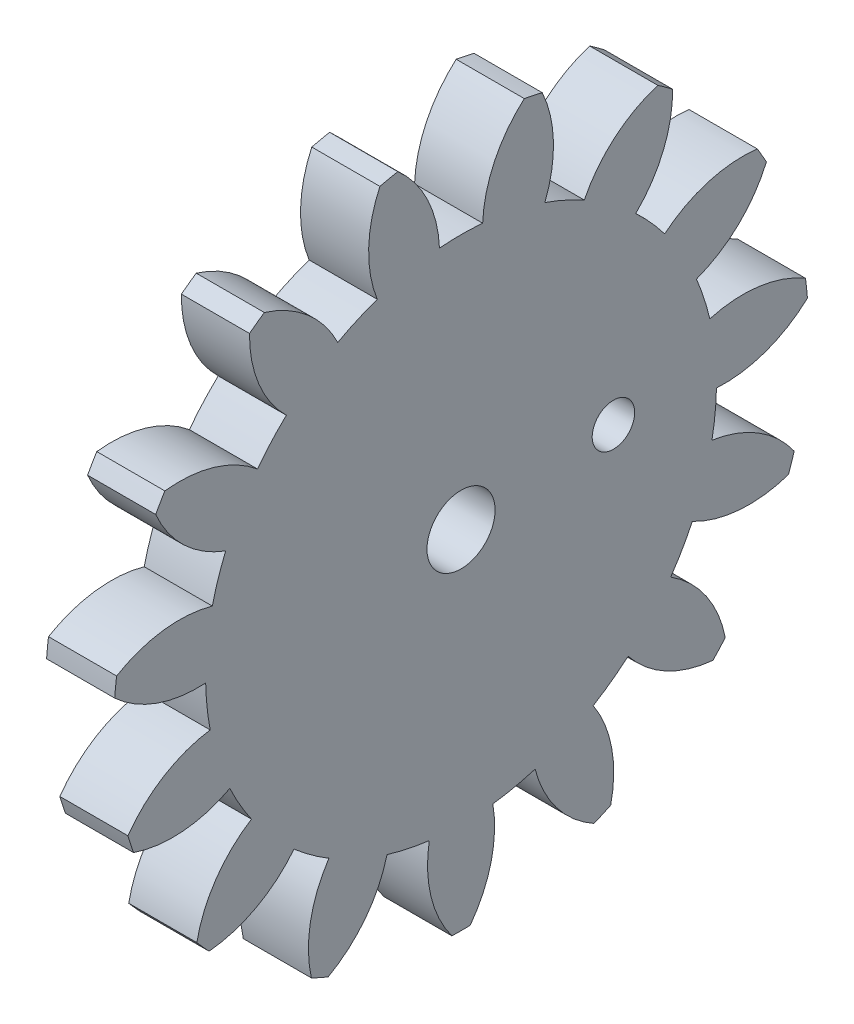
ISO-10303-21;
HEADER;
FILE_DESCRIPTION(('STEP AP214'),'2;1');
FILE_NAME('part.step','',(''),(''),'','','');
FILE_SCHEMA(('AUTOMOTIVE_DESIGN { 1 0 10303 214 1 1 1 1 }'));
ENDSEC;
DATA;
#1=APPLICATION_CONTEXT('core data for automotive mechanical design processes');
#2=APPLICATION_PROTOCOL_DEFINITION('international standard','automotive_design',2000,#1);
#3=PRODUCT_CONTEXT('',#1,'mechanical');
#4=PRODUCT('Part','Part','',(#3));
#5=PRODUCT_RELATED_PRODUCT_CATEGORY('part','',(#4));
#6=PRODUCT_DEFINITION_FORMATION('','',#4);
#7=PRODUCT_DEFINITION_CONTEXT('part definition',#1,'design');
#8=PRODUCT_DEFINITION('design','',#6,#7);
#9=PRODUCT_DEFINITION_SHAPE('','',#8);
#10=(LENGTH_UNIT() NAMED_UNIT(*) SI_UNIT(.MILLI.,.METRE.));
#11=(NAMED_UNIT(*) PLANE_ANGLE_UNIT() SI_UNIT($,.RADIAN.));
#12=(NAMED_UNIT(*) SI_UNIT($,.STERADIAN.) SOLID_ANGLE_UNIT());
#13=UNCERTAINTY_MEASURE_WITH_UNIT(LENGTH_MEASURE(1.E-05),#10,'distance_accuracy_value','');
#14=(GEOMETRIC_REPRESENTATION_CONTEXT(3) GLOBAL_UNCERTAINTY_ASSIGNED_CONTEXT((#13)) GLOBAL_UNIT_ASSIGNED_CONTEXT((#10,
#11,#12)) REPRESENTATION_CONTEXT('',''));
#15=CARTESIAN_POINT('',(0.,0.,0.));
#16=DIRECTION('',(0.,0.,1.));
#17=DIRECTION('',(1.,0.,0.));
#18=AXIS2_PLACEMENT_3D('',#15,#16,#17);
#19=CARTESIAN_POINT('',(5.,0.,0.));
#20=DIRECTION('',(-1.,0.,0.));
#21=DIRECTION('',(0.,0.,1.));
#22=AXIS2_PLACEMENT_3D('',#19,#20,#21);
#23=PLANE('',#22);
#24=CARTESIAN_POINT('',(5.,1.07296947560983,-11.1847775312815));
#25=DIRECTION('',(1.,0.,0.));
#26=DIRECTION('',(0.,0.,-1.));
#27=AXIS2_PLACEMENT_3D('',#24,#25,#26);
#28=CIRCLE('',#27,1.55885401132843);
#29=CARTESIAN_POINT('',(5.,1.07296947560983,-12.7436315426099));
#30=VERTEX_POINT('',#29);
#31=EDGE_CURVE('E766',#30,#30,#28,.T.);
#32=ORIENTED_EDGE('',*,*,#31,.F.);
#33=EDGE_LOOP('',(#32));
#34=FACE_BOUND('',#33,.T.);
#35=CARTESIAN_POINT('',(5.,12.4226809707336,-17.1086819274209));
#36=DIRECTION('',(-1.,0.,0.));
#37=DIRECTION('',(0.,-0.406736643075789,-0.913545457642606));
#38=AXIS2_PLACEMENT_3D('',#35,#36,#37);
#39=CIRCLE('',#38,9.);
#40=CARTESIAN_POINT('',(5.,16.4222687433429,-9.04621967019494));
#41=VERTEX_POINT('',#40);
#42=CARTESIAN_POINT('',(5.,21.0177974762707,-14.4396048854));
#43=VERTEX_POINT('',#42);
#44=EDGE_CURVE('E424',#41,#43,#39,.T.);
#45=ORIENTED_EDGE('',*,*,#44,.F.);
#46=CARTESIAN_POINT('',(5.,0.,0.));
#47=DIRECTION('',(-1.,0.,0.));
#48=DIRECTION('',(0.,-0.406736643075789,-0.913545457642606));
#49=AXIS2_PLACEMENT_3D('',#46,#47,#48);
#50=CIRCLE('',#49,18.749);
#51=CARTESIAN_POINT('',(5.,17.7112939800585,-6.15102158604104));
#52=VERTEX_POINT('',#51);
#53=EDGE_CURVE('E757',#52,#41,#50,.T.);
#54=ORIENTED_EDGE('',*,*,#53,.F.);
#55=CARTESIAN_POINT('',(5.,21.0266244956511,2.21609163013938));
#56=DIRECTION('',(-1.,0.,0.));
#57=DIRECTION('',(0.,-0.406736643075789,-0.913545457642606));
#58=AXIS2_PLACEMENT_3D('',#55,#56,#57);
#59=CIRCLE('',#58,9.);
#60=CARTESIAN_POINT('',(5.,24.794369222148,-5.95728586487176));
#61=VERTEX_POINT('',#60);
#62=EDGE_CURVE('E414',#61,#52,#59,.T.);
#63=ORIENTED_EDGE('',*,*,#62,.F.);
#64=CARTESIAN_POINT('',(5.,0.,0.));
#65=DIRECTION('',(-1.,0.,0.));
#66=DIRECTION('',(0.,0.,1.));
#67=AXIS2_PLACEMENT_3D('',#64,#65,#66);
#68=CIRCLE('',#67,25.5);
#69=CARTESIAN_POINT('',(5.,25.0738298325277,-4.64252706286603));
#70=VERTEX_POINT('',#69);
#71=EDGE_CURVE('E442',#70,#61,#68,.T.);
#72=ORIENTED_EDGE('',*,*,#71,.F.);
#73=CARTESIAN_POINT('',(5.,18.3074116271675,-10.5767991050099));
#74=DIRECTION('',(-1.,0.,0.));
#75=DIRECTION('',(0.,0.,-1.));
#76=AXIS2_PLACEMENT_3D('',#73,#74,#75);
#77=CIRCLE('',#76,9.);
#78=CARTESIAN_POINT('',(5.,18.6819180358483,-1.58459442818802));
#79=VERTEX_POINT('',#78);
#80=EDGE_CURVE('E466',#79,#70,#77,.T.);
#81=ORIENTED_EDGE('',*,*,#80,.F.);
#82=CARTESIAN_POINT('',(5.,0.,0.));
#83=DIRECTION('',(-1.,0.,0.));
#84=DIRECTION('',(0.,0.,-1.));
#85=AXIS2_PLACEMENT_3D('',#82,#83,#84);
#86=CIRCLE('',#85,18.749);
#87=CARTESIAN_POINT('',(5.,18.6819180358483,1.58459442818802));
#88=VERTEX_POINT('',#87);
#89=EDGE_CURVE('E462',#88,#79,#86,.T.);
#90=ORIENTED_EDGE('',*,*,#89,.F.);
#91=CARTESIAN_POINT('',(5.,18.3074116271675,10.5767991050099));
#92=DIRECTION('',(-1.,0.,0.));
#93=DIRECTION('',(0.,0.,-1.));
#94=AXIS2_PLACEMENT_3D('',#91,#92,#93);
#95=CIRCLE('',#94,9.);
#96=CARTESIAN_POINT('',(5.,25.0738298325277,4.64252706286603));
#97=VERTEX_POINT('',#96);
#98=EDGE_CURVE('E464',#97,#88,#95,.T.);
#99=ORIENTED_EDGE('',*,*,#98,.F.);
#100=CARTESIAN_POINT('',(5.,24.7943692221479,5.95728586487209));
#101=VERTEX_POINT('',#100);
#102=EDGE_CURVE('E436',#101,#97,#68,.T.);
#103=ORIENTED_EDGE('',*,*,#102,.F.);
#104=CARTESIAN_POINT('',(5.,21.0266244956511,-2.2160916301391));
#105=DIRECTION('',(-1.,0.,0.));
#106=DIRECTION('',(0.,0.406736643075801,-0.913545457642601));
#107=AXIS2_PLACEMENT_3D('',#104,#105,#106);
#108=CIRCLE('',#107,9.);
#109=CARTESIAN_POINT('',(5.,17.7112939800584,6.15102158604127));
#110=VERTEX_POINT('',#109);
#111=EDGE_CURVE('E485',#110,#101,#108,.T.);
#112=ORIENTED_EDGE('',*,*,#111,.F.);
#113=CARTESIAN_POINT('',(5.,0.,0.));
#114=DIRECTION('',(-1.,0.,0.));
#115=DIRECTION('',(0.,0.406736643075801,-0.913545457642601));
#116=AXIS2_PLACEMENT_3D('',#113,#114,#115);
#117=CIRCLE('',#116,18.749);
#118=CARTESIAN_POINT('',(5.,16.4222687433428,9.04621967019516));
#119=VERTEX_POINT('',#118);
#120=EDGE_CURVE('E481',#119,#110,#117,.T.);
#121=ORIENTED_EDGE('',*,*,#120,.F.);
#122=CARTESIAN_POINT('',(5.,12.4226809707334,17.1086819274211));
#123=DIRECTION('',(-1.,0.,0.));
#124=DIRECTION('',(0.,0.406736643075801,-0.913545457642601));
#125=AXIS2_PLACEMENT_3D('',#122,#123,#124);
#126=CIRCLE('',#125,9.);
#127=CARTESIAN_POINT('',(5.,21.0177974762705,14.4396048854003));
#128=VERTEX_POINT('',#127);
#129=EDGE_CURVE('E483',#128,#119,#126,.T.);
#130=ORIENTED_EDGE('',*,*,#129,.F.);
#131=CARTESIAN_POINT('',(5.,20.2277369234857,15.5270299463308));
#132=VERTEX_POINT('',#131);
#133=EDGE_CURVE('E440',#132,#128,#68,.T.);
#134=ORIENTED_EDGE('',*,*,#133,.F.);
#135=CARTESIAN_POINT('',(5.,20.1101429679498,6.52779822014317));
#136=DIRECTION('',(-1.,0.,0.));
#137=DIRECTION('',(0.,0.743144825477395,-0.669130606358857));
#138=AXIS2_PLACEMENT_3D('',#135,#136,#137);
#139=CIRCLE('',#138,9.);
#140=CARTESIAN_POINT('',(5.,13.6782262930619,12.8230700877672));
#141=VERTEX_POINT('',#140);
#142=EDGE_CURVE('E506',#141,#132,#139,.T.);
#143=ORIENTED_EDGE('',*,*,#142,.F.);
#144=CARTESIAN_POINT('',(5.,0.,0.));
#145=DIRECTION('',(-1.,0.,0.));
#146=DIRECTION('',(0.,0.743144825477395,-0.669130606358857));
#147=AXIS2_PLACEMENT_3D('',#144,#145,#146);
#148=CIRCLE('',#147,18.749);
#149=CARTESIAN_POINT('',(5.,11.3230599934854,14.9436713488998));
#150=VERTEX_POINT('',#149);
#151=EDGE_CURVE('E502',#150,#141,#148,.T.);
#152=ORIENTED_EDGE('',*,*,#151,.F.);
#153=CARTESIAN_POINT('',(5.,4.38995591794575,20.6823182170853));
#154=DIRECTION('',(-1.,0.,0.));
#155=DIRECTION('',(0.,0.743144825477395,-0.669130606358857));
#156=AXIS2_PLACEMENT_3D('',#153,#154,#155);
#157=CIRCLE('',#156,9.);
#158=CARTESIAN_POINT('',(5.,13.3275969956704,21.7399438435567));
#159=VERTEX_POINT('',#158);
#160=EDGE_CURVE('E504',#159,#150,#157,.T.);
#161=ORIENTED_EDGE('',*,*,#160,.F.);
#162=CARTESIAN_POINT('',(5.,12.1635451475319,22.4120094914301));
#163=VERTEX_POINT('',#162);
#164=EDGE_CURVE('E869',#163,#159,#68,.T.);
#165=ORIENTED_EDGE('',*,*,#164,.F.);
#166=CARTESIAN_POINT('',(5.,15.7164350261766,14.1429724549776));
#167=DIRECTION('',(-1.,0.,0.));
#168=DIRECTION('',(0.,0.951056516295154,-0.309016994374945));
#169=AXIS2_PLACEMENT_3D('',#166,#167,#168);
#170=CIRCLE('',#169,9.);
#171=CARTESIAN_POINT('',(5.,7.28006901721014,17.2778932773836));
#172=VERTEX_POINT('',#171);
#173=EDGE_CURVE('E528',#172,#163,#170,.T.);
#174=ORIENTED_EDGE('',*,*,#173,.F.);
#175=CARTESIAN_POINT('',(5.,0.,0.));
#176=DIRECTION('',(-1.,0.,0.));
#177=DIRECTION('',(0.,0.951056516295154,-0.309016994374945));
#178=AXIS2_PLACEMENT_3D('',#175,#176,#177);
#179=CIRCLE('',#178,18.749);
#180=CARTESIAN_POINT('',(5.,4.26599130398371,18.2572264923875));
#181=VERTEX_POINT('',#180);
#182=EDGE_CURVE('E524',#181,#172,#179,.T.);
#183=ORIENTED_EDGE('',*,*,#182,.F.);
#184=CARTESIAN_POINT('',(5.,-4.40183239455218,20.6797937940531));
#185=DIRECTION('',(-1.,0.,0.));
#186=DIRECTION('',(0.,0.951056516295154,-0.309016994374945));
#187=AXIS2_PLACEMENT_3D('',#184,#185,#186);
#188=CIRCLE('',#187,9.);
#189=CARTESIAN_POINT('',(5.,3.33293391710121,25.2812490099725));
#190=VERTEX_POINT('',#189);
#191=EDGE_CURVE('E526',#190,#181,#188,.T.);
#192=ORIENTED_EDGE('',*,*,#191,.F.);
#193=CARTESIAN_POINT('',(5.,1.99616591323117,25.4217489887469));
#194=VERTEX_POINT('',#193);
#195=EDGE_CURVE('E864',#194,#190,#68,.T.);
#196=ORIENTED_EDGE('',*,*,#195,.F.);
#197=CARTESIAN_POINT('',(5.,8.60521268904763,19.3126982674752));
#198=DIRECTION('',(-1.,0.,0.));
#199=DIRECTION('',(0.,0.994521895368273,0.104528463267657));
#200=AXIS2_PLACEMENT_3D('',#197,#198,#199);
#201=CIRCLE('',#200,9.);
#202=CARTESIAN_POINT('',(5.,-0.376878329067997,18.7452117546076));
#203=VERTEX_POINT('',#202);
#204=EDGE_CURVE('E550',#203,#194,#201,.T.);
#205=ORIENTED_EDGE('',*,*,#204,.F.);
#206=CARTESIAN_POINT('',(5.,0.,0.));
#207=DIRECTION('',(-1.,0.,0.));
#208=DIRECTION('',(0.,0.994521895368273,0.104528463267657));
#209=AXIS2_PLACEMENT_3D('',#206,#207,#208);
#210=CIRCLE('',#209,18.749);
#211=CARTESIAN_POINT('',(5.,-3.52870603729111,18.4139413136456));
#212=VERTEX_POINT('',#211);
#213=EDGE_CURVE('E546',#212,#203,#210,.T.);
#214=ORIENTED_EDGE('',*,*,#213,.F.);
#215=CARTESIAN_POINT('',(5.,-12.4325038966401,17.1015451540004));
#216=DIRECTION('',(-1.,0.,0.));
#217=DIRECTION('',(0.,0.994521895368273,0.104528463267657));
#218=AXIS2_PLACEMENT_3D('',#215,#216,#217);
#219=CIRCLE('',#218,9.);
#220=CARTESIAN_POINT('',(5.,-7.23802371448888,24.4511965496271));
#221=VERTEX_POINT('',#220);
#222=EDGE_CURVE('E548',#221,#212,#219,.T.);
#223=ORIENTED_EDGE('',*,*,#222,.F.);
#224=CARTESIAN_POINT('',(5.,-8.51636854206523,24.0358371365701));
#225=VERTEX_POINT('',#224);
#226=EDGE_CURVE('E859',#225,#221,#68,.T.);
#227=ORIENTED_EDGE('',*,*,#226,.F.);
#228=CARTESIAN_POINT('',(5.,0.00607090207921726,21.1430830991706));
#229=DIRECTION('',(-1.,0.,0.));
#230=DIRECTION('',(0.,0.866025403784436,0.500000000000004));
#231=AXIS2_PLACEMENT_3D('',#228,#229,#230);
#232=CIRCLE('',#231,9.);
#233=CARTESIAN_POINT('',(5.,-7.96865998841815,16.9713128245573));
#234=VERTEX_POINT('',#233);
#235=EDGE_CURVE('E572',#234,#225,#232,.T.);
#236=ORIENTED_EDGE('',*,*,#235,.F.);
#237=CARTESIAN_POINT('',(5.,0.,0.));
#238=DIRECTION('',(-1.,0.,0.));
#239=DIRECTION('',(0.,0.866025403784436,0.500000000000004));
#240=AXIS2_PLACEMENT_3D('',#237,#238,#239);
#241=CIRCLE('',#240,18.749);
#242=CARTESIAN_POINT('',(5.,-10.7132580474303,15.3867183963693));
#243=VERTEX_POINT('',#242);
#244=EDGE_CURVE('E568',#243,#234,#241,.T.);
#245=ORIENTED_EDGE('',*,*,#244,.F.);
#246=CARTESIAN_POINT('',(5.,-18.3134825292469,10.5662839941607));
#247=DIRECTION('',(-1.,0.,0.));
#248=DIRECTION('',(0.,0.866025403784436,0.500000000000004));
#249=AXIS2_PLACEMENT_3D('',#246,#247,#248);
#250=CIRCLE('',#249,9.);
#251=CARTESIAN_POINT('',(5.,-16.5574612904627,19.393310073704));
#252=VERTEX_POINT('',#251);
#253=EDGE_CURVE('E570',#252,#243,#250,.T.);
#254=ORIENTED_EDGE('',*,*,#253,.F.);
#255=CARTESIAN_POINT('',(5.,-17.5563455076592,18.493910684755));
#256=VERTEX_POINT('',#255);
#257=EDGE_CURVE('E854',#256,#252,#68,.T.);
#258=ORIENTED_EDGE('',*,*,#257,.F.);
#259=CARTESIAN_POINT('',(5.,-8.5941205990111,19.3176367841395));
#260=DIRECTION('',(-1.,0.,0.));
#261=DIRECTION('',(0.,0.587785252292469,0.80901699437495));
#262=AXIS2_PLACEMENT_3D('',#259,#260,#261);
#263=CIRCLE('',#262,9.);
#264=CARTESIAN_POINT('',(5.,-14.1825879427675,12.2629197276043));
#265=VERTEX_POINT('',#264);
#266=EDGE_CURVE('E594',#265,#256,#263,.T.);
#267=ORIENTED_EDGE('',*,*,#266,.F.);
#268=CARTESIAN_POINT('',(5.,0.,0.));
#269=DIRECTION('',(-1.,0.,0.));
#270=DIRECTION('',(0.,0.587785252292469,0.80901699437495));
#271=AXIS2_PLACEMENT_3D('',#268,#269,#270);
#272=CIRCLE('',#271,18.749);
#273=CARTESIAN_POINT('',(5.,-16.0453904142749,9.69899208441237));
#274=VERTEX_POINT('',#273);
#275=EDGE_CURVE('E590',#274,#265,#272,.T.);
#276=ORIENTED_EDGE('',*,*,#275,.F.);
#277=CARTESIAN_POINT('',(5.,-21.0278936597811,2.20401634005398));
#278=DIRECTION('',(-1.,0.,0.));
#279=DIRECTION('',(0.,0.587785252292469,0.80901699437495));
#280=AXIS2_PLACEMENT_3D('',#277,#278,#279);
#281=CIRCLE('',#280,9.);
#282=CARTESIAN_POINT('',(5.,-23.0139633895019,10.9821441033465));
#283=VERTEX_POINT('',#282);
#284=EDGE_CURVE('E592',#283,#274,#281,.T.);
#285=ORIENTED_EDGE('',*,*,#284,.F.);
#286=CARTESIAN_POINT('',(5.,-23.5606708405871,9.75421906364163));
#287=VERTEX_POINT('',#286);
#288=EDGE_CURVE('E849',#287,#283,#68,.T.);
#289=ORIENTED_EDGE('',*,*,#288,.F.);
#290=CARTESIAN_POINT('',(5.,-15.7083105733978,14.1519955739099));
#291=DIRECTION('',(-1.,0.,0.));
#292=DIRECTION('',(0.,0.207911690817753,0.978147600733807));
#293=AXIS2_PLACEMENT_3D('',#290,#291,#292);
#294=CIRCLE('',#293,9.);
#295=CARTESIAN_POINT('',(5.,-17.9442175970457,5.43415640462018));
#296=VERTEX_POINT('',#295);
#297=EDGE_CURVE('E616',#296,#287,#294,.T.);
#298=ORIENTED_EDGE('',*,*,#297,.F.);
#299=CARTESIAN_POINT('',(5.,0.,0.));
#300=DIRECTION('',(-1.,0.,0.));
#301=DIRECTION('',(0.,0.207911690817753,0.978147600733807));
#302=AXIS2_PLACEMENT_3D('',#299,#300,#301);
#303=CIRCLE('',#302,18.749);
#304=CARTESIAN_POINT('',(5.,-18.6031290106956,2.33422192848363));
#305=VERTEX_POINT('',#304);
#306=EDGE_CURVE('E612',#305,#296,#303,.T.);
#307=ORIENTED_EDGE('',*,*,#306,.F.);
#308=CARTESIAN_POINT('',(5.,-20.1063909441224,-6.5393457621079));
#309=DIRECTION('',(-1.,0.,0.));
#310=DIRECTION('',(0.,0.207911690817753,0.978147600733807));
#311=AXIS2_PLACEMENT_3D('',#308,#309,#310);
#312=CIRCLE('',#311,9.);
#313=CARTESIAN_POINT('',(5.,-25.4911421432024,0.672065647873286));
#314=VERTEX_POINT('',#313);
#315=EDGE_CURVE('E614',#314,#305,#312,.T.);
#316=ORIENTED_EDGE('',*,*,#315,.F.);
#317=CARTESIAN_POINT('',(5.,-25.4911421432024,-0.67206564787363));
#318=VERTEX_POINT('',#317);
#319=EDGE_CURVE('E844',#318,#314,#68,.T.);
#320=ORIENTED_EDGE('',*,*,#319,.F.);
#321=CARTESIAN_POINT('',(5.,-20.1063909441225,6.53934576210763));
#322=DIRECTION('',(-1.,0.,0.));
#323=DIRECTION('',(0.,-0.207911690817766,0.978147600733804));
#324=AXIS2_PLACEMENT_3D('',#321,#322,#323);
#325=CIRCLE('',#324,9.);
#326=CARTESIAN_POINT('',(5.,-18.6031290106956,-2.33422192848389));
#327=VERTEX_POINT('',#326);
#328=EDGE_CURVE('E638',#327,#318,#325,.T.);
#329=ORIENTED_EDGE('',*,*,#328,.F.);
#330=CARTESIAN_POINT('',(5.,0.,0.));
#331=DIRECTION('',(-1.,0.,0.));
#332=DIRECTION('',(0.,-0.207911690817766,0.978147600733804));
#333=AXIS2_PLACEMENT_3D('',#330,#331,#332);
#334=CIRCLE('',#333,18.749);
#335=CARTESIAN_POINT('',(5.,-17.9442175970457,-5.43415640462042));
#336=VERTEX_POINT('',#335);
#337=EDGE_CURVE('E634',#336,#327,#334,.T.);
#338=ORIENTED_EDGE('',*,*,#337,.F.);
#339=CARTESIAN_POINT('',(5.,-15.7083105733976,-14.1519955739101));
#340=DIRECTION('',(-1.,0.,0.));
#341=DIRECTION('',(0.,-0.207911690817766,0.978147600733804));
#342=AXIS2_PLACEMENT_3D('',#339,#340,#341);
#343=CIRCLE('',#342,9.);
#344=CARTESIAN_POINT('',(5.,-23.560670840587,-9.75421906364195));
#345=VERTEX_POINT('',#344);
#346=EDGE_CURVE('E636',#345,#336,#343,.T.);
#347=ORIENTED_EDGE('',*,*,#346,.F.);
#348=CARTESIAN_POINT('',(5.,-23.0139633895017,-10.9821441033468));
#349=VERTEX_POINT('',#348);
#350=EDGE_CURVE('E839',#349,#345,#68,.T.);
#351=ORIENTED_EDGE('',*,*,#350,.F.);
#352=CARTESIAN_POINT('',(5.,-21.0278936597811,-2.20401634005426));
#353=DIRECTION('',(-1.,0.,0.));
#354=DIRECTION('',(0.,-0.58778525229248,0.809016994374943));
#355=AXIS2_PLACEMENT_3D('',#352,#353,#354);
#356=CIRCLE('',#355,9.);
#357=CARTESIAN_POINT('',(5.,-16.0453904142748,-9.69899208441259));
#358=VERTEX_POINT('',#357);
#359=EDGE_CURVE('E660',#358,#349,#356,.T.);
#360=ORIENTED_EDGE('',*,*,#359,.F.);
#361=CARTESIAN_POINT('',(5.,0.,0.));
#362=DIRECTION('',(-1.,0.,0.));
#363=DIRECTION('',(0.,-0.58778525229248,0.809016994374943));
#364=AXIS2_PLACEMENT_3D('',#361,#362,#363);
#365=CIRCLE('',#364,18.749);
#366=CARTESIAN_POINT('',(5.,-14.1825879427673,-12.2629197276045));
#367=VERTEX_POINT('',#366);
#368=EDGE_CURVE('E656',#367,#358,#365,.T.);
#369=ORIENTED_EDGE('',*,*,#368,.F.);
#370=CARTESIAN_POINT('',(5.,-8.59412059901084,-19.3176367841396));
#371=DIRECTION('',(-1.,0.,0.));
#372=DIRECTION('',(0.,-0.58778525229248,0.809016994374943));
#373=AXIS2_PLACEMENT_3D('',#370,#371,#372);
#374=CIRCLE('',#373,9.);
#375=CARTESIAN_POINT('',(5.,-17.556345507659,-18.4939106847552));
#376=VERTEX_POINT('',#375);
#377=EDGE_CURVE('E658',#376,#367,#374,.T.);
#378=ORIENTED_EDGE('',*,*,#377,.F.);
#379=CARTESIAN_POINT('',(5.,-16.5574612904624,-19.3933100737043));
#380=VERTEX_POINT('',#379);
#381=EDGE_CURVE('E834',#380,#376,#68,.T.);
#382=ORIENTED_EDGE('',*,*,#381,.F.);
#383=CARTESIAN_POINT('',(5.,-18.3134825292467,-10.5662839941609));
#384=DIRECTION('',(-1.,0.,0.));
#385=DIRECTION('',(0.,-0.866025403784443,0.499999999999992));
#386=AXIS2_PLACEMENT_3D('',#383,#384,#385);
#387=CIRCLE('',#386,9.);
#388=CARTESIAN_POINT('',(5.,-10.7132580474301,-15.3867183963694));
#389=VERTEX_POINT('',#388);
#390=EDGE_CURVE('E682',#389,#380,#387,.T.);
#391=ORIENTED_EDGE('',*,*,#390,.F.);
#392=CARTESIAN_POINT('',(5.,0.,0.));
#393=DIRECTION('',(-1.,0.,0.));
#394=DIRECTION('',(0.,-0.866025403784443,0.499999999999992));
#395=AXIS2_PLACEMENT_3D('',#392,#393,#394);
#396=CIRCLE('',#395,18.749);
#397=CARTESIAN_POINT('',(5.,-7.96865998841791,-16.9713128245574));
#398=VERTEX_POINT('',#397);
#399=EDGE_CURVE('E678',#398,#389,#396,.T.);
#400=ORIENTED_EDGE('',*,*,#399,.F.);
#401=CARTESIAN_POINT('',(5.,0.00607090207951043,-21.1430830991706));
#402=DIRECTION('',(-1.,0.,0.));
#403=DIRECTION('',(0.,-0.866025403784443,0.499999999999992));
#404=AXIS2_PLACEMENT_3D('',#401,#402,#403);
#405=CIRCLE('',#404,9.);
#406=CARTESIAN_POINT('',(5.,-8.5163685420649,-24.0358371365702));
#407=VERTEX_POINT('',#406);
#408=EDGE_CURVE('E680',#407,#398,#405,.T.);
#409=ORIENTED_EDGE('',*,*,#408,.F.);
#410=CARTESIAN_POINT('',(5.,-7.23802371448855,-24.4511965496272));
#411=VERTEX_POINT('',#410);
#412=EDGE_CURVE('E829',#411,#407,#68,.T.);
#413=ORIENTED_EDGE('',*,*,#412,.F.);
#414=CARTESIAN_POINT('',(5.,-12.4325038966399,-17.1015451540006));
#415=DIRECTION('',(-1.,0.,0.));
#416=DIRECTION('',(0.,-0.994521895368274,0.104528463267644));
#417=AXIS2_PLACEMENT_3D('',#414,#415,#416);
#418=CIRCLE('',#417,9.);
#419=CARTESIAN_POINT('',(5.,-3.52870603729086,-18.4139413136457));
#420=VERTEX_POINT('',#419);
#421=EDGE_CURVE('E704',#420,#411,#418,.T.);
#422=ORIENTED_EDGE('',*,*,#421,.F.);
#423=CARTESIAN_POINT('',(5.,0.,0.));
#424=DIRECTION('',(-1.,0.,0.));
#425=DIRECTION('',(0.,-0.994521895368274,0.104528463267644));
#426=AXIS2_PLACEMENT_3D('',#423,#424,#425);
#427=CIRCLE('',#426,18.749);
#428=CARTESIAN_POINT('',(5.,-0.376878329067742,-18.7452117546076));
#429=VERTEX_POINT('',#428);
#430=EDGE_CURVE('E700',#429,#420,#427,.T.);
#431=ORIENTED_EDGE('',*,*,#430,.F.);
#432=CARTESIAN_POINT('',(5.,8.60521268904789,-19.3126982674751));
#433=DIRECTION('',(-1.,0.,0.));
#434=DIRECTION('',(0.,-0.994521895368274,0.104528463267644));
#435=AXIS2_PLACEMENT_3D('',#432,#433,#434);
#436=CIRCLE('',#435,9.);
#437=CARTESIAN_POINT('',(5.,1.99616591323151,-25.4217489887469));
#438=VERTEX_POINT('',#437);
#439=EDGE_CURVE('E702',#438,#429,#436,.T.);
#440=ORIENTED_EDGE('',*,*,#439,.F.);
#441=CARTESIAN_POINT('',(5.,3.33293391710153,-25.2812490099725));
#442=VERTEX_POINT('',#441);
#443=EDGE_CURVE('E824',#442,#438,#68,.T.);
#444=ORIENTED_EDGE('',*,*,#443,.F.);
#445=CARTESIAN_POINT('',(5.,-4.40183239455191,-20.6797937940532));
#446=DIRECTION('',(-1.,0.,0.));
#447=DIRECTION('',(0.,-0.95105651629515,-0.309016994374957));
#448=AXIS2_PLACEMENT_3D('',#445,#446,#447);
#449=CIRCLE('',#448,9.);
#450=CARTESIAN_POINT('',(5.,4.26599130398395,-18.2572264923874));
#451=VERTEX_POINT('',#450);
#452=EDGE_CURVE('E726',#451,#442,#449,.T.);
#453=ORIENTED_EDGE('',*,*,#452,.F.);
#454=CARTESIAN_POINT('',(5.,0.,0.));
#455=DIRECTION('',(-1.,0.,0.));
#456=DIRECTION('',(0.,-0.95105651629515,-0.309016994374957));
#457=AXIS2_PLACEMENT_3D('',#454,#455,#456);
#458=CIRCLE('',#457,18.749);
#459=CARTESIAN_POINT('',(5.,7.28006901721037,-17.2778932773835));
#460=VERTEX_POINT('',#459);
#461=EDGE_CURVE('E722',#460,#451,#458,.T.);
#462=ORIENTED_EDGE('',*,*,#461,.F.);
#463=CARTESIAN_POINT('',(5.,15.7164350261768,-14.1429724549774));
#464=DIRECTION('',(-1.,0.,0.));
#465=DIRECTION('',(0.,-0.95105651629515,-0.309016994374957));
#466=AXIS2_PLACEMENT_3D('',#463,#464,#465);
#467=CIRCLE('',#466,9.);
#468=CARTESIAN_POINT('',(5.,12.1635451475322,-22.41200949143));
#469=VERTEX_POINT('',#468);
#470=EDGE_CURVE('E724',#469,#460,#467,.T.);
#471=ORIENTED_EDGE('',*,*,#470,.F.);
#472=CARTESIAN_POINT('',(5.,13.3275969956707,-21.7399438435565));
#473=VERTEX_POINT('',#472);
#474=EDGE_CURVE('E819',#473,#469,#68,.T.);
#475=ORIENTED_EDGE('',*,*,#474,.F.);
#476=CARTESIAN_POINT('',(5.,4.38995591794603,-20.6823182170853));
#477=DIRECTION('',(-1.,0.,0.));
#478=DIRECTION('',(0.,-0.743144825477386,-0.669130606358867));
#479=AXIS2_PLACEMENT_3D('',#476,#477,#478);
#480=CIRCLE('',#479,9.);
#481=CARTESIAN_POINT('',(5.,11.3230599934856,-14.9436713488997));
#482=VERTEX_POINT('',#481);
#483=EDGE_CURVE('E747',#482,#473,#480,.T.);
#484=ORIENTED_EDGE('',*,*,#483,.F.);
#485=CARTESIAN_POINT('',(5.,0.,0.));
#486=DIRECTION('',(-1.,0.,0.));
#487=DIRECTION('',(0.,-0.743144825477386,-0.669130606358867));
#488=AXIS2_PLACEMENT_3D('',#485,#486,#487);
#489=CIRCLE('',#488,18.749);
#490=CARTESIAN_POINT('',(5.,13.6782262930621,-12.823070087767));
#491=VERTEX_POINT('',#490);
#492=EDGE_CURVE('E743',#491,#482,#489,.T.);
#493=ORIENTED_EDGE('',*,*,#492,.F.);
#494=CARTESIAN_POINT('',(5.,20.1101429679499,-6.52779822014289));
#495=DIRECTION('',(-1.,0.,0.));
#496=DIRECTION('',(0.,-0.743144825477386,-0.669130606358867));
#497=AXIS2_PLACEMENT_3D('',#494,#495,#496);
#498=CIRCLE('',#497,9.);
#499=CARTESIAN_POINT('',(5.,20.2277369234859,-15.5270299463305));
#500=VERTEX_POINT('',#499);
#501=EDGE_CURVE('E745',#500,#491,#498,.T.);
#502=ORIENTED_EDGE('',*,*,#501,.F.);
#503=EDGE_CURVE('E817',#43,#500,#68,.T.);
#504=ORIENTED_EDGE('',*,*,#503,.F.);
#505=EDGE_LOOP('',(#45,#54,#63,#72,#81,#90,#99,#103,#112,#121,#130,#134,#143,#152,#161,#165,
#174,#183,#192,#196,#205,#214,#223,#227,#236,#245,#254,#258,#267,#276,#285,#289,#298,#307,#316,
#320,#329,#338,#347,#351,#360,#369,#378,#382,#391,#400,#409,#413,#422,#431,#440,#444,#453,#462,
#471,#475,#484,#493,#502,#504));
#506=FACE_BOUND('',#505,.T.);
#507=CARTESIAN_POINT('',(5.,0.,0.));
#508=DIRECTION('',(-1.,0.,0.));
#509=DIRECTION('',(0.,0.,1.));
#510=AXIS2_PLACEMENT_3D('',#507,#508,#509);
#511=CIRCLE('',#510,2.5);
#512=CARTESIAN_POINT('',(5.,0.,2.5));
#513=VERTEX_POINT('',#512);
#514=EDGE_CURVE('E762',#513,#513,#511,.F.);
#515=ORIENTED_EDGE('',*,*,#514,.F.);
#516=EDGE_LOOP('',(#515));
#517=FACE_BOUND('',#516,.T.);
#518=ADVANCED_FACE('F30',(#34,#506,#517),#23,.F.);
#519=CARTESIAN_POINT('',(0.,0.,0.));
#520=DIRECTION('',(1.,0.,0.));
#521=DIRECTION('',(0.,0.,-1.));
#522=AXIS2_PLACEMENT_3D('',#519,#520,#521);
#523=PLANE('',#522);
#524=CARTESIAN_POINT('',(0.,1.07296947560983,-11.1847775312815));
#525=DIRECTION('',(1.,0.,0.));
#526=DIRECTION('',(0.,0.,-1.));
#527=AXIS2_PLACEMENT_3D('',#524,#525,#526);
#528=CIRCLE('',#527,1.55885401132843);
#529=CARTESIAN_POINT('',(0.,1.07296947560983,-12.7436315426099));
#530=VERTEX_POINT('',#529);
#531=EDGE_CURVE('E33',#530,#530,#528,.T.);
#532=ORIENTED_EDGE('',*,*,#531,.T.);
#533=EDGE_LOOP('',(#532));
#534=FACE_BOUND('',#533,.T.);
#535=CARTESIAN_POINT('',(0.,12.4226809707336,-17.1086819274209));
#536=DIRECTION('',(-1.,0.,0.));
#537=DIRECTION('',(0.,-0.406736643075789,-0.913545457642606));
#538=AXIS2_PLACEMENT_3D('',#535,#536,#537);
#539=CIRCLE('',#538,9.);
#540=CARTESIAN_POINT('',(0.,16.4222687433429,-9.04621967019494));
#541=VERTEX_POINT('',#540);
#542=CARTESIAN_POINT('',(0.,21.0177974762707,-14.4396048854));
#543=VERTEX_POINT('',#542);
#544=EDGE_CURVE('E46',#541,#543,#539,.T.);
#545=ORIENTED_EDGE('',*,*,#544,.T.);
#546=CARTESIAN_POINT('',(0.,0.,0.));
#547=DIRECTION('',(-1.,0.,0.));
#548=DIRECTION('',(0.,0.,1.));
#549=AXIS2_PLACEMENT_3D('',#546,#547,#548);
#550=CIRCLE('',#549,25.5);
#551=CARTESIAN_POINT('',(0.,20.2277369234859,-15.5270299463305));
#552=VERTEX_POINT('',#551);
#553=EDGE_CURVE('E437',#543,#552,#550,.T.);
#554=ORIENTED_EDGE('',*,*,#553,.T.);
#555=CARTESIAN_POINT('',(0.,20.1101429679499,-6.52779822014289));
#556=DIRECTION('',(1.,0.,0.));
#557=DIRECTION('',(0.,0.,-1.));
#558=AXIS2_PLACEMENT_3D('',#555,#556,#557);
#559=CIRCLE('',#558,9.);
#560=CARTESIAN_POINT('',(0.,13.6782262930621,-12.823070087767));
#561=VERTEX_POINT('',#560);
#562=EDGE_CURVE('E38',#561,#552,#559,.T.);
#563=ORIENTED_EDGE('',*,*,#562,.F.);
#564=CARTESIAN_POINT('',(0.,0.,0.));
#565=DIRECTION('',(-1.,0.,0.));
#566=DIRECTION('',(0.,-0.743144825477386,-0.669130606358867));
#567=AXIS2_PLACEMENT_3D('',#564,#565,#566);
#568=CIRCLE('',#567,18.749);
#569=CARTESIAN_POINT('',(0.,11.3230599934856,-14.9436713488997));
#570=VERTEX_POINT('',#569);
#571=EDGE_CURVE('E749',#561,#570,#568,.T.);
#572=ORIENTED_EDGE('',*,*,#571,.T.);
#573=CARTESIAN_POINT('',(0.,4.38995591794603,-20.6823182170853));
#574=DIRECTION('',(-1.,0.,0.));
#575=DIRECTION('',(0.,-0.743144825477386,-0.669130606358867));
#576=AXIS2_PLACEMENT_3D('',#573,#574,#575);
#577=CIRCLE('',#576,9.);
#578=CARTESIAN_POINT('',(0.,13.3275969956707,-21.7399438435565));
#579=VERTEX_POINT('',#578);
#580=EDGE_CURVE('E54',#570,#579,#577,.T.);
#581=ORIENTED_EDGE('',*,*,#580,.T.);
#582=CARTESIAN_POINT('',(0.,12.1635451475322,-22.41200949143));
#583=VERTEX_POINT('',#582);
#584=EDGE_CURVE('E443',#579,#583,#550,.T.);
#585=ORIENTED_EDGE('',*,*,#584,.T.);
#586=CARTESIAN_POINT('',(0.,15.7164350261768,-14.1429724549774));
#587=DIRECTION('',(1.,0.,0.));
#588=DIRECTION('',(0.,0.,-1.));
#589=AXIS2_PLACEMENT_3D('',#586,#587,#588);
#590=CIRCLE('',#589,9.);
#591=CARTESIAN_POINT('',(0.,7.28006901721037,-17.2778932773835));
#592=VERTEX_POINT('',#591);
#593=EDGE_CURVE('E779',#592,#583,#590,.T.);
#594=ORIENTED_EDGE('',*,*,#593,.F.);
#595=CARTESIAN_POINT('',(0.,0.,0.));
#596=DIRECTION('',(-1.,0.,0.));
#597=DIRECTION('',(0.,-0.95105651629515,-0.309016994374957));
#598=AXIS2_PLACEMENT_3D('',#595,#596,#597);
#599=CIRCLE('',#598,18.749);
#600=CARTESIAN_POINT('',(0.,4.26599130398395,-18.2572264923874));
#601=VERTEX_POINT('',#600);
#602=EDGE_CURVE('E728',#592,#601,#599,.T.);
#603=ORIENTED_EDGE('',*,*,#602,.T.);
#604=CARTESIAN_POINT('',(0.,-4.40183239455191,-20.6797937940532));
#605=DIRECTION('',(-1.,0.,0.));
#606=DIRECTION('',(0.,-0.95105651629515,-0.309016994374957));
#607=AXIS2_PLACEMENT_3D('',#604,#605,#606);
#608=CIRCLE('',#607,9.);
#609=CARTESIAN_POINT('',(0.,3.33293391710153,-25.2812490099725));
#610=VERTEX_POINT('',#609);
#611=EDGE_CURVE('E731',#601,#610,#608,.T.);
#612=ORIENTED_EDGE('',*,*,#611,.T.);
#613=CARTESIAN_POINT('',(0.,1.99616591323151,-25.4217489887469));
#614=VERTEX_POINT('',#613);
#615=EDGE_CURVE('E934',#610,#614,#550,.T.);
#616=ORIENTED_EDGE('',*,*,#615,.T.);
#617=CARTESIAN_POINT('',(0.,8.60521268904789,-19.3126982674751));
#618=DIRECTION('',(1.,0.,0.));
#619=DIRECTION('',(0.,0.,-1.));
#620=AXIS2_PLACEMENT_3D('',#617,#618,#619);
#621=CIRCLE('',#620,9.);
#622=CARTESIAN_POINT('',(0.,-0.376878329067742,-18.7452117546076));
#623=VERTEX_POINT('',#622);
#624=EDGE_CURVE('E782',#623,#614,#621,.T.);
#625=ORIENTED_EDGE('',*,*,#624,.F.);
#626=CARTESIAN_POINT('',(0.,0.,0.));
#627=DIRECTION('',(-1.,0.,0.));
#628=DIRECTION('',(0.,-0.994521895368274,0.104528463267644));
#629=AXIS2_PLACEMENT_3D('',#626,#627,#628);
#630=CIRCLE('',#629,18.749);
#631=CARTESIAN_POINT('',(0.,-3.52870603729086,-18.4139413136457));
#632=VERTEX_POINT('',#631);
#633=EDGE_CURVE('E706',#623,#632,#630,.T.);
#634=ORIENTED_EDGE('',*,*,#633,.T.);
#635=CARTESIAN_POINT('',(0.,-12.4325038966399,-17.1015451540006));
#636=DIRECTION('',(-1.,0.,0.));
#637=DIRECTION('',(0.,-0.994521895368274,0.104528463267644));
#638=AXIS2_PLACEMENT_3D('',#635,#636,#637);
#639=CIRCLE('',#638,9.);
#640=CARTESIAN_POINT('',(0.,-7.23802371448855,-24.4511965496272));
#641=VERTEX_POINT('',#640);
#642=EDGE_CURVE('E709',#632,#641,#639,.T.);
#643=ORIENTED_EDGE('',*,*,#642,.T.);
#644=CARTESIAN_POINT('',(0.,-8.51636854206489,-24.0358371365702));
#645=VERTEX_POINT('',#644);
#646=EDGE_CURVE('E935',#641,#645,#550,.T.);
#647=ORIENTED_EDGE('',*,*,#646,.T.);
#648=CARTESIAN_POINT('',(0.,0.00607090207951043,-21.1430830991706));
#649=DIRECTION('',(1.,0.,0.));
#650=DIRECTION('',(0.,0.,-1.));
#651=AXIS2_PLACEMENT_3D('',#648,#649,#650);
#652=CIRCLE('',#651,9.);
#653=CARTESIAN_POINT('',(0.,-7.96865998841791,-16.9713128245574));
#654=VERTEX_POINT('',#653);
#655=EDGE_CURVE('E785',#654,#645,#652,.T.);
#656=ORIENTED_EDGE('',*,*,#655,.F.);
#657=CARTESIAN_POINT('',(0.,0.,0.));
#658=DIRECTION('',(-1.,0.,0.));
#659=DIRECTION('',(0.,-0.866025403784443,0.499999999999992));
#660=AXIS2_PLACEMENT_3D('',#657,#658,#659);
#661=CIRCLE('',#660,18.749);
#662=CARTESIAN_POINT('',(0.,-10.7132580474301,-15.3867183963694));
#663=VERTEX_POINT('',#662);
#664=EDGE_CURVE('E684',#654,#663,#661,.T.);
#665=ORIENTED_EDGE('',*,*,#664,.T.);
#666=CARTESIAN_POINT('',(0.,-18.3134825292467,-10.5662839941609));
#667=DIRECTION('',(-1.,0.,0.));
#668=DIRECTION('',(0.,-0.866025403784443,0.499999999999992));
#669=AXIS2_PLACEMENT_3D('',#666,#667,#668);
#670=CIRCLE('',#669,9.);
#671=CARTESIAN_POINT('',(0.,-16.5574612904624,-19.3933100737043));
#672=VERTEX_POINT('',#671);
#673=EDGE_CURVE('E687',#663,#672,#670,.T.);
#674=ORIENTED_EDGE('',*,*,#673,.T.);
#675=CARTESIAN_POINT('',(0.,-17.556345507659,-18.4939106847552));
#676=VERTEX_POINT('',#675);
#677=EDGE_CURVE('E938',#672,#676,#550,.T.);
#678=ORIENTED_EDGE('',*,*,#677,.T.);
#679=CARTESIAN_POINT('',(0.,-8.59412059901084,-19.3176367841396));
#680=DIRECTION('',(1.,0.,0.));
#681=DIRECTION('',(0.,0.,-1.));
#682=AXIS2_PLACEMENT_3D('',#679,#680,#681);
#683=CIRCLE('',#682,9.);
#684=CARTESIAN_POINT('',(0.,-14.1825879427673,-12.2629197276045));
#685=VERTEX_POINT('',#684);
#686=EDGE_CURVE('E788',#685,#676,#683,.T.);
#687=ORIENTED_EDGE('',*,*,#686,.F.);
#688=CARTESIAN_POINT('',(0.,0.,0.));
#689=DIRECTION('',(-1.,0.,0.));
#690=DIRECTION('',(0.,-0.58778525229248,0.809016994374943));
#691=AXIS2_PLACEMENT_3D('',#688,#689,#690);
#692=CIRCLE('',#691,18.749);
#693=CARTESIAN_POINT('',(0.,-16.0453904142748,-9.69899208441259));
#694=VERTEX_POINT('',#693);
#695=EDGE_CURVE('E662',#685,#694,#692,.T.);
#696=ORIENTED_EDGE('',*,*,#695,.T.);
#697=CARTESIAN_POINT('',(0.,-21.0278936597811,-2.20401634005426));
#698=DIRECTION('',(-1.,0.,0.));
#699=DIRECTION('',(0.,-0.58778525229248,0.809016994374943));
#700=AXIS2_PLACEMENT_3D('',#697,#698,#699);
#701=CIRCLE('',#700,9.);
#702=CARTESIAN_POINT('',(0.,-23.0139633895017,-10.9821441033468));
#703=VERTEX_POINT('',#702);
#704=EDGE_CURVE('E665',#694,#703,#701,.T.);
#705=ORIENTED_EDGE('',*,*,#704,.T.);
#706=CARTESIAN_POINT('',(0.,-23.5606708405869,-9.75421906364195));
#707=VERTEX_POINT('',#706);
#708=EDGE_CURVE('E941',#703,#707,#550,.T.);
#709=ORIENTED_EDGE('',*,*,#708,.T.);
#710=CARTESIAN_POINT('',(0.,-15.7083105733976,-14.1519955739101));
#711=DIRECTION('',(1.,0.,0.));
#712=DIRECTION('',(0.,0.,-1.));
#713=AXIS2_PLACEMENT_3D('',#710,#711,#712);
#714=CIRCLE('',#713,9.);
#715=CARTESIAN_POINT('',(0.,-17.9442175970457,-5.43415640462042));
#716=VERTEX_POINT('',#715);
#717=EDGE_CURVE('E791',#716,#707,#714,.T.);
#718=ORIENTED_EDGE('',*,*,#717,.F.);
#719=CARTESIAN_POINT('',(0.,0.,0.));
#720=DIRECTION('',(-1.,0.,0.));
#721=DIRECTION('',(0.,-0.207911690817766,0.978147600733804));
#722=AXIS2_PLACEMENT_3D('',#719,#720,#721);
#723=CIRCLE('',#722,18.749);
#724=CARTESIAN_POINT('',(0.,-18.6031290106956,-2.33422192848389));
#725=VERTEX_POINT('',#724);
#726=EDGE_CURVE('E640',#716,#725,#723,.T.);
#727=ORIENTED_EDGE('',*,*,#726,.T.);
#728=CARTESIAN_POINT('',(0.,-20.1063909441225,6.53934576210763));
#729=DIRECTION('',(-1.,0.,0.));
#730=DIRECTION('',(0.,-0.207911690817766,0.978147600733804));
#731=AXIS2_PLACEMENT_3D('',#728,#729,#730);
#732=CIRCLE('',#731,9.);
#733=CARTESIAN_POINT('',(0.,-25.4911421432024,-0.672065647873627));
#734=VERTEX_POINT('',#733);
#735=EDGE_CURVE('E643',#725,#734,#732,.T.);
#736=ORIENTED_EDGE('',*,*,#735,.T.);
#737=CARTESIAN_POINT('',(0.,-25.4911421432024,0.672065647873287));
#738=VERTEX_POINT('',#737);
#739=EDGE_CURVE('E944',#734,#738,#550,.T.);
#740=ORIENTED_EDGE('',*,*,#739,.T.);
#741=CARTESIAN_POINT('',(0.,-20.1063909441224,-6.5393457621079));
#742=DIRECTION('',(1.,0.,0.));
#743=DIRECTION('',(0.,0.,-1.));
#744=AXIS2_PLACEMENT_3D('',#741,#742,#743);
#745=CIRCLE('',#744,9.);
#746=CARTESIAN_POINT('',(0.,-18.6031290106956,2.33422192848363));
#747=VERTEX_POINT('',#746);
#748=EDGE_CURVE('E794',#747,#738,#745,.T.);
#749=ORIENTED_EDGE('',*,*,#748,.F.);
#750=CARTESIAN_POINT('',(0.,0.,0.));
#751=DIRECTION('',(-1.,0.,0.));
#752=DIRECTION('',(0.,0.207911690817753,0.978147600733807));
#753=AXIS2_PLACEMENT_3D('',#750,#751,#752);
#754=CIRCLE('',#753,18.749);
#755=CARTESIAN_POINT('',(0.,-17.9442175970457,5.43415640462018));
#756=VERTEX_POINT('',#755);
#757=EDGE_CURVE('E618',#747,#756,#754,.T.);
#758=ORIENTED_EDGE('',*,*,#757,.T.);
#759=CARTESIAN_POINT('',(0.,-15.7083105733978,14.1519955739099));
#760=DIRECTION('',(-1.,0.,0.));
#761=DIRECTION('',(0.,0.207911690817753,0.978147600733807));
#762=AXIS2_PLACEMENT_3D('',#759,#760,#761);
#763=CIRCLE('',#762,9.);
#764=CARTESIAN_POINT('',(0.,-23.5606708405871,9.75421906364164));
#765=VERTEX_POINT('',#764);
#766=EDGE_CURVE('E621',#756,#765,#763,.T.);
#767=ORIENTED_EDGE('',*,*,#766,.T.);
#768=CARTESIAN_POINT('',(0.,-23.0139633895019,10.9821441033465));
#769=VERTEX_POINT('',#768);
#770=EDGE_CURVE('E947',#765,#769,#550,.T.);
#771=ORIENTED_EDGE('',*,*,#770,.T.);
#772=CARTESIAN_POINT('',(0.,-21.0278936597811,2.20401634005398));
#773=DIRECTION('',(1.,0.,0.));
#774=DIRECTION('',(0.,0.,-1.));
#775=AXIS2_PLACEMENT_3D('',#772,#773,#774);
#776=CIRCLE('',#775,9.);
#777=CARTESIAN_POINT('',(0.,-16.0453904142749,9.69899208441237));
#778=VERTEX_POINT('',#777);
#779=EDGE_CURVE('E797',#778,#769,#776,.T.);
#780=ORIENTED_EDGE('',*,*,#779,.F.);
#781=CARTESIAN_POINT('',(0.,0.,0.));
#782=DIRECTION('',(-1.,0.,0.));
#783=DIRECTION('',(0.,0.587785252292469,0.80901699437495));
#784=AXIS2_PLACEMENT_3D('',#781,#782,#783);
#785=CIRCLE('',#784,18.749);
#786=CARTESIAN_POINT('',(0.,-14.1825879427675,12.2629197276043));
#787=VERTEX_POINT('',#786);
#788=EDGE_CURVE('E596',#778,#787,#785,.T.);
#789=ORIENTED_EDGE('',*,*,#788,.T.);
#790=CARTESIAN_POINT('',(0.,-8.5941205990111,19.3176367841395));
#791=DIRECTION('',(-1.,0.,0.));
#792=DIRECTION('',(0.,0.587785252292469,0.80901699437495));
#793=AXIS2_PLACEMENT_3D('',#790,#791,#792);
#794=CIRCLE('',#793,9.);
#795=CARTESIAN_POINT('',(0.,-17.5563455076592,18.493910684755));
#796=VERTEX_POINT('',#795);
#797=EDGE_CURVE('E599',#787,#796,#794,.T.);
#798=ORIENTED_EDGE('',*,*,#797,.T.);
#799=CARTESIAN_POINT('',(0.,-16.5574612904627,19.393310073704));
#800=VERTEX_POINT('',#799);
#801=EDGE_CURVE('E950',#796,#800,#550,.T.);
#802=ORIENTED_EDGE('',*,*,#801,.T.);
#803=CARTESIAN_POINT('',(0.,-18.3134825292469,10.5662839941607));
#804=DIRECTION('',(1.,0.,0.));
#805=DIRECTION('',(0.,0.,-1.));
#806=AXIS2_PLACEMENT_3D('',#803,#804,#805);
#807=CIRCLE('',#806,9.);
#808=CARTESIAN_POINT('',(0.,-10.7132580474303,15.3867183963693));
#809=VERTEX_POINT('',#808);
#810=EDGE_CURVE('E800',#809,#800,#807,.T.);
#811=ORIENTED_EDGE('',*,*,#810,.F.);
#812=CARTESIAN_POINT('',(0.,0.,0.));
#813=DIRECTION('',(-1.,0.,0.));
#814=DIRECTION('',(0.,0.866025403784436,0.500000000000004));
#815=AXIS2_PLACEMENT_3D('',#812,#813,#814);
#816=CIRCLE('',#815,18.749);
#817=CARTESIAN_POINT('',(0.,-7.96865998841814,16.9713128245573));
#818=VERTEX_POINT('',#817);
#819=EDGE_CURVE('E574',#809,#818,#816,.T.);
#820=ORIENTED_EDGE('',*,*,#819,.T.);
#821=CARTESIAN_POINT('',(0.,0.00607090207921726,21.1430830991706));
#822=DIRECTION('',(-1.,0.,0.));
#823=DIRECTION('',(0.,0.866025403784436,0.500000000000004));
#824=AXIS2_PLACEMENT_3D('',#821,#822,#823);
#825=CIRCLE('',#824,9.);
#826=CARTESIAN_POINT('',(0.,-8.51636854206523,24.0358371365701));
#827=VERTEX_POINT('',#826);
#828=EDGE_CURVE('E577',#818,#827,#825,.T.);
#829=ORIENTED_EDGE('',*,*,#828,.T.);
#830=CARTESIAN_POINT('',(0.,-7.23802371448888,24.4511965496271));
#831=VERTEX_POINT('',#830);
#832=EDGE_CURVE('E953',#827,#831,#550,.T.);
#833=ORIENTED_EDGE('',*,*,#832,.T.);
#834=CARTESIAN_POINT('',(0.,-12.4325038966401,17.1015451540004));
#835=DIRECTION('',(1.,0.,0.));
#836=DIRECTION('',(0.,0.,-1.));
#837=AXIS2_PLACEMENT_3D('',#834,#835,#836);
#838=CIRCLE('',#837,9.);
#839=CARTESIAN_POINT('',(0.,-3.52870603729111,18.4139413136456));
#840=VERTEX_POINT('',#839);
#841=EDGE_CURVE('E803',#840,#831,#838,.T.);
#842=ORIENTED_EDGE('',*,*,#841,.F.);
#843=CARTESIAN_POINT('',(0.,0.,0.));
#844=DIRECTION('',(-1.,0.,0.));
#845=DIRECTION('',(0.,0.994521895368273,0.104528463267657));
#846=AXIS2_PLACEMENT_3D('',#843,#844,#845);
#847=CIRCLE('',#846,18.749);
#848=CARTESIAN_POINT('',(0.,-0.376878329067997,18.7452117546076));
#849=VERTEX_POINT('',#848);
#850=EDGE_CURVE('E552',#840,#849,#847,.T.);
#851=ORIENTED_EDGE('',*,*,#850,.T.);
#852=CARTESIAN_POINT('',(0.,8.60521268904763,19.3126982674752));
#853=DIRECTION('',(-1.,0.,0.));
#854=DIRECTION('',(0.,0.994521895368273,0.104528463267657));
#855=AXIS2_PLACEMENT_3D('',#852,#853,#854);
#856=CIRCLE('',#855,9.);
#857=CARTESIAN_POINT('',(0.,1.99616591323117,25.4217489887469));
#858=VERTEX_POINT('',#857);
#859=EDGE_CURVE('E555',#849,#858,#856,.T.);
#860=ORIENTED_EDGE('',*,*,#859,.T.);
#861=CARTESIAN_POINT('',(0.,3.33293391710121,25.2812490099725));
#862=VERTEX_POINT('',#861);
#863=EDGE_CURVE('E956',#858,#862,#550,.T.);
#864=ORIENTED_EDGE('',*,*,#863,.T.);
#865=CARTESIAN_POINT('',(0.,-4.40183239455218,20.6797937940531));
#866=DIRECTION('',(1.,0.,0.));
#867=DIRECTION('',(0.,0.,-1.));
#868=AXIS2_PLACEMENT_3D('',#865,#866,#867);
#869=CIRCLE('',#868,9.);
#870=CARTESIAN_POINT('',(0.,4.26599130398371,18.2572264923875));
#871=VERTEX_POINT('',#870);
#872=EDGE_CURVE('E806',#871,#862,#869,.T.);
#873=ORIENTED_EDGE('',*,*,#872,.F.);
#874=CARTESIAN_POINT('',(0.,0.,0.));
#875=DIRECTION('',(-1.,0.,0.));
#876=DIRECTION('',(0.,0.951056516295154,-0.309016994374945));
#877=AXIS2_PLACEMENT_3D('',#874,#875,#876);
#878=CIRCLE('',#877,18.749);
#879=CARTESIAN_POINT('',(0.,7.28006901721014,17.2778932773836));
#880=VERTEX_POINT('',#879);
#881=EDGE_CURVE('E530',#871,#880,#878,.T.);
#882=ORIENTED_EDGE('',*,*,#881,.T.);
#883=CARTESIAN_POINT('',(0.,15.7164350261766,14.1429724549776));
#884=DIRECTION('',(-1.,0.,0.));
#885=DIRECTION('',(0.,0.951056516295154,-0.309016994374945));
#886=AXIS2_PLACEMENT_3D('',#883,#884,#885);
#887=CIRCLE('',#886,9.);
#888=CARTESIAN_POINT('',(0.,12.1635451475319,22.4120094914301));
#889=VERTEX_POINT('',#888);
#890=EDGE_CURVE('E533',#880,#889,#887,.T.);
#891=ORIENTED_EDGE('',*,*,#890,.T.);
#892=CARTESIAN_POINT('',(0.,13.3275969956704,21.7399438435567));
#893=VERTEX_POINT('',#892);
#894=EDGE_CURVE('E451',#889,#893,#550,.T.);
#895=ORIENTED_EDGE('',*,*,#894,.T.);
#896=CARTESIAN_POINT('',(0.,4.38995591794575,20.6823182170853));
#897=DIRECTION('',(1.,0.,0.));
#898=DIRECTION('',(0.,0.,-1.));
#899=AXIS2_PLACEMENT_3D('',#896,#897,#898);
#900=CIRCLE('',#899,9.);
#901=CARTESIAN_POINT('',(0.,11.3230599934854,14.9436713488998));
#902=VERTEX_POINT('',#901);
#903=EDGE_CURVE('E809',#902,#893,#900,.T.);
#904=ORIENTED_EDGE('',*,*,#903,.F.);
#905=CARTESIAN_POINT('',(0.,0.,0.));
#906=DIRECTION('',(-1.,0.,0.));
#907=DIRECTION('',(0.,0.743144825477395,-0.669130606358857));
#908=AXIS2_PLACEMENT_3D('',#905,#906,#907);
#909=CIRCLE('',#908,18.749);
#910=CARTESIAN_POINT('',(0.,13.6782262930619,12.8230700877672));
#911=VERTEX_POINT('',#910);
#912=EDGE_CURVE('E508',#902,#911,#909,.T.);
#913=ORIENTED_EDGE('',*,*,#912,.T.);
#914=CARTESIAN_POINT('',(0.,20.1101429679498,6.52779822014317));
#915=DIRECTION('',(-1.,0.,0.));
#916=DIRECTION('',(0.,0.743144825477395,-0.669130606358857));
#917=AXIS2_PLACEMENT_3D('',#914,#915,#916);
#918=CIRCLE('',#917,9.);
#919=CARTESIAN_POINT('',(0.,20.2277369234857,15.5270299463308));
#920=VERTEX_POINT('',#919);
#921=EDGE_CURVE('E511',#911,#920,#918,.T.);
#922=ORIENTED_EDGE('',*,*,#921,.T.);
#923=CARTESIAN_POINT('',(0.,21.0177974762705,14.4396048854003));
#924=VERTEX_POINT('',#923);
#925=EDGE_CURVE('E445',#920,#924,#550,.T.);
#926=ORIENTED_EDGE('',*,*,#925,.T.);
#927=CARTESIAN_POINT('',(0.,12.4226809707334,17.1086819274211));
#928=DIRECTION('',(1.,0.,0.));
#929=DIRECTION('',(0.,0.,-1.));
#930=AXIS2_PLACEMENT_3D('',#927,#928,#929);
#931=CIRCLE('',#930,9.);
#932=CARTESIAN_POINT('',(0.,16.4222687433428,9.04621967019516));
#933=VERTEX_POINT('',#932);
#934=EDGE_CURVE('E812',#933,#924,#931,.T.);
#935=ORIENTED_EDGE('',*,*,#934,.F.);
#936=CARTESIAN_POINT('',(0.,0.,0.));
#937=DIRECTION('',(-1.,0.,0.));
#938=DIRECTION('',(0.,0.406736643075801,-0.913545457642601));
#939=AXIS2_PLACEMENT_3D('',#936,#937,#938);
#940=CIRCLE('',#939,18.749);
#941=CARTESIAN_POINT('',(0.,17.7112939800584,6.15102158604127));
#942=VERTEX_POINT('',#941);
#943=EDGE_CURVE('E487',#933,#942,#940,.T.);
#944=ORIENTED_EDGE('',*,*,#943,.T.);
#945=CARTESIAN_POINT('',(0.,21.0266244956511,-2.2160916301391));
#946=DIRECTION('',(-1.,0.,0.));
#947=DIRECTION('',(0.,0.406736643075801,-0.913545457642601));
#948=AXIS2_PLACEMENT_3D('',#945,#946,#947);
#949=CIRCLE('',#948,9.);
#950=CARTESIAN_POINT('',(0.,24.7943692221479,5.95728586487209));
#951=VERTEX_POINT('',#950);
#952=EDGE_CURVE('E490',#942,#951,#949,.T.);
#953=ORIENTED_EDGE('',*,*,#952,.T.);
#954=CARTESIAN_POINT('',(0.,25.0738298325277,4.64252706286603));
#955=VERTEX_POINT('',#954);
#956=EDGE_CURVE('E439',#951,#955,#550,.T.);
#957=ORIENTED_EDGE('',*,*,#956,.T.);
#958=CARTESIAN_POINT('',(0.,18.3074116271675,10.5767991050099));
#959=DIRECTION('',(1.,0.,0.));
#960=DIRECTION('',(0.,0.,-1.));
#961=AXIS2_PLACEMENT_3D('',#958,#959,#960);
#962=CIRCLE('',#961,9.);
#963=CARTESIAN_POINT('',(0.,18.6819180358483,1.58459442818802));
#964=VERTEX_POINT('',#963);
#965=EDGE_CURVE('E815',#964,#955,#962,.T.);
#966=ORIENTED_EDGE('',*,*,#965,.F.);
#967=CARTESIAN_POINT('',(0.,0.,0.));
#968=DIRECTION('',(-1.,0.,0.));
#969=DIRECTION('',(0.,0.,-1.));
#970=AXIS2_PLACEMENT_3D('',#967,#968,#969);
#971=CIRCLE('',#970,18.749);
#972=CARTESIAN_POINT('',(0.,18.6819180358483,-1.58459442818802));
#973=VERTEX_POINT('',#972);
#974=EDGE_CURVE('E468',#964,#973,#971,.T.);
#975=ORIENTED_EDGE('',*,*,#974,.T.);
#976=CARTESIAN_POINT('',(0.,18.3074116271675,-10.5767991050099));
#977=DIRECTION('',(-1.,0.,0.));
#978=DIRECTION('',(0.,0.,-1.));
#979=AXIS2_PLACEMENT_3D('',#976,#977,#978);
#980=CIRCLE('',#979,9.);
#981=CARTESIAN_POINT('',(0.,25.0738298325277,-4.64252706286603));
#982=VERTEX_POINT('',#981);
#983=EDGE_CURVE('E433',#973,#982,#980,.T.);
#984=ORIENTED_EDGE('',*,*,#983,.T.);
#985=CARTESIAN_POINT('',(0.,24.794369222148,-5.95728586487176));
#986=VERTEX_POINT('',#985);
#987=EDGE_CURVE('E431',#982,#986,#550,.T.);
#988=ORIENTED_EDGE('',*,*,#987,.T.);
#989=CARTESIAN_POINT('',(0.,21.0266244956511,2.21609163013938));
#990=DIRECTION('',(1.,0.,0.));
#991=DIRECTION('',(0.,0.,-1.));
#992=AXIS2_PLACEMENT_3D('',#989,#990,#991);
#993=CIRCLE('',#992,9.);
#994=CARTESIAN_POINT('',(0.,17.7112939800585,-6.15102158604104));
#995=VERTEX_POINT('',#994);
#996=EDGE_CURVE('E11',#995,#986,#993,.T.);
#997=ORIENTED_EDGE('',*,*,#996,.F.);
#998=CARTESIAN_POINT('',(0.,0.,0.));
#999=DIRECTION('',(-1.,0.,0.));
#1000=DIRECTION('',(0.,-0.406736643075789,-0.913545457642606));
#1001=AXIS2_PLACEMENT_3D('',#998,#999,#1000);
#1002=CIRCLE('',#1001,18.749);
#1003=EDGE_CURVE('E421',#995,#541,#1002,.T.);
#1004=ORIENTED_EDGE('',*,*,#1003,.T.);
#1005=EDGE_LOOP('',(#545,#554,#563,#572,#581,#585,#594,#603,#612,#616,#625,#634,#643,#647,#656,
#665,#674,#678,#687,#696,#705,#709,#718,#727,#736,#740,#749,#758,#767,#771,#780,#789,#798,#802,
#811,#820,#829,#833,#842,#851,#860,#864,#873,#882,#891,#895,#904,#913,#922,#926,#935,#944,#953,
#957,#966,#975,#984,#988,#997,#1004));
#1006=FACE_BOUND('',#1005,.T.);
#1007=CARTESIAN_POINT('',(0.,0.,0.));
#1008=DIRECTION('',(1.,0.,0.));
#1009=DIRECTION('',(0.,0.,-1.));
#1010=AXIS2_PLACEMENT_3D('',#1007,#1008,#1009);
#1011=CIRCLE('',#1010,2.5);
#1012=CARTESIAN_POINT('',(0.,0.,-2.5));
#1013=VERTEX_POINT('',#1012);
#1014=EDGE_CURVE('E765',#1013,#1013,#1011,.F.);
#1015=ORIENTED_EDGE('',*,*,#1014,.F.);
#1016=EDGE_LOOP('',(#1015));
#1017=FACE_BOUND('',#1016,.T.);
#1018=ADVANCED_FACE('F427',(#534,#1006,#1017),#523,.F.);
#1019=CARTESIAN_POINT('',(-10.,0.,0.));
#1020=DIRECTION('',(-1.,0.,0.));
#1021=DIRECTION('',(0.,0.,1.));
#1022=AXIS2_PLACEMENT_3D('',#1019,#1020,#1021);
#1023=CYLINDRICAL_SURFACE('',#1022,25.5);
#1024=DIRECTION('',(-1.,0.,0.));
#1025=VECTOR('',#1024,1.);
#1026=CARTESIAN_POINT('',(2.5,21.0177974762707,-14.4396048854));
#1027=LINE('',#1026,#1025);
#1028=EDGE_CURVE('E753',#43,#543,#1027,.T.);
#1029=ORIENTED_EDGE('',*,*,#1028,.F.);
#1030=ORIENTED_EDGE('',*,*,#503,.T.);
#1031=DIRECTION('',(-1.,0.,0.));
#1032=VECTOR('',#1031,1.);
#1033=CARTESIAN_POINT('',(2.5,20.2277369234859,-15.5270299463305));
#1034=LINE('',#1033,#1032);
#1035=EDGE_CURVE('E736',#552,#500,#1034,.F.);
#1036=ORIENTED_EDGE('',*,*,#1035,.F.);
#1037=ORIENTED_EDGE('',*,*,#553,.F.);
#1038=EDGE_LOOP('',(#1029,#1030,#1036,#1037));
#1039=FACE_BOUND('',#1038,.T.);
#1040=ADVANCED_FACE('F920',(#1039),#1023,.T.);
#1041=DIRECTION('',(-1.,0.,0.));
#1042=VECTOR('',#1041,1.);
#1043=CARTESIAN_POINT('',(2.5,24.794369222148,-5.95728586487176));
#1044=LINE('',#1043,#1042);
#1045=EDGE_CURVE('E417',#986,#61,#1044,.F.);
#1046=ORIENTED_EDGE('',*,*,#1045,.F.);
#1047=ORIENTED_EDGE('',*,*,#987,.F.);
#1048=DIRECTION('',(-1.,0.,0.));
#1049=VECTOR('',#1048,1.);
#1050=CARTESIAN_POINT('',(2.5,25.0738298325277,-4.64252706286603));
#1051=LINE('',#1050,#1049);
#1052=EDGE_CURVE('E446',#70,#982,#1051,.T.);
#1053=ORIENTED_EDGE('',*,*,#1052,.F.);
#1054=ORIENTED_EDGE('',*,*,#71,.T.);
#1055=EDGE_LOOP('',(#1046,#1047,#1053,#1054));
#1056=FACE_BOUND('',#1055,.T.);
#1057=ADVANCED_FACE('F917',(#1056),#1023,.T.);
#1058=DIRECTION('',(-1.,0.,0.));
#1059=VECTOR('',#1058,1.);
#1060=CARTESIAN_POINT('',(2.5,13.3275969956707,-21.7399438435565));
#1061=LINE('',#1060,#1059);
#1062=EDGE_CURVE('E734',#473,#579,#1061,.T.);
#1063=ORIENTED_EDGE('',*,*,#1062,.F.);
#1064=ORIENTED_EDGE('',*,*,#474,.T.);
#1065=DIRECTION('',(-1.,0.,0.));
#1066=VECTOR('',#1065,1.);
#1067=CARTESIAN_POINT('',(2.5,12.1635451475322,-22.41200949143));
#1068=LINE('',#1067,#1066);
#1069=EDGE_CURVE('E714',#583,#469,#1068,.F.);
#1070=ORIENTED_EDGE('',*,*,#1069,.F.);
#1071=ORIENTED_EDGE('',*,*,#584,.F.);
#1072=EDGE_LOOP('',(#1063,#1064,#1070,#1071));
#1073=FACE_BOUND('',#1072,.T.);
#1074=ADVANCED_FACE('F933',(#1073),#1023,.T.);
#1075=DIRECTION('',(-1.,0.,0.));
#1076=VECTOR('',#1075,1.);
#1077=CARTESIAN_POINT('',(2.5,3.33293391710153,-25.2812490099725));
#1078=LINE('',#1077,#1076);
#1079=EDGE_CURVE('E712',#442,#610,#1078,.T.);
#1080=ORIENTED_EDGE('',*,*,#1079,.F.);
#1081=ORIENTED_EDGE('',*,*,#443,.T.);
#1082=DIRECTION('',(-1.,0.,0.));
#1083=VECTOR('',#1082,1.);
#1084=CARTESIAN_POINT('',(2.5,1.99616591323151,-25.4217489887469));
#1085=LINE('',#1084,#1083);
#1086=EDGE_CURVE('E692',#614,#438,#1085,.F.);
#1087=ORIENTED_EDGE('',*,*,#1086,.F.);
#1088=ORIENTED_EDGE('',*,*,#615,.F.);
#1089=EDGE_LOOP('',(#1080,#1081,#1087,#1088));
#1090=FACE_BOUND('',#1089,.T.);
#1091=ADVANCED_FACE('F1342',(#1090),#1023,.T.);
#1092=DIRECTION('',(-1.,0.,0.));
#1093=VECTOR('',#1092,1.);
#1094=CARTESIAN_POINT('',(2.5,-7.23802371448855,-24.4511965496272));
#1095=LINE('',#1094,#1093);
#1096=EDGE_CURVE('E690',#411,#641,#1095,.T.);
#1097=ORIENTED_EDGE('',*,*,#1096,.F.);
#1098=ORIENTED_EDGE('',*,*,#412,.T.);
#1099=DIRECTION('',(-1.,0.,0.));
#1100=VECTOR('',#1099,1.);
#1101=CARTESIAN_POINT('',(2.5,-8.5163685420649,-24.0358371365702));
#1102=LINE('',#1101,#1100);
#1103=EDGE_CURVE('E670',#645,#407,#1102,.F.);
#1104=ORIENTED_EDGE('',*,*,#1103,.F.);
#1105=ORIENTED_EDGE('',*,*,#646,.F.);
#1106=EDGE_LOOP('',(#1097,#1098,#1104,#1105));
#1107=FACE_BOUND('',#1106,.T.);
#1108=ADVANCED_FACE('F1348',(#1107),#1023,.T.);
#1109=DIRECTION('',(-1.,0.,0.));
#1110=VECTOR('',#1109,1.);
#1111=CARTESIAN_POINT('',(2.5,-16.5574612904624,-19.3933100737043));
#1112=LINE('',#1111,#1110);
#1113=EDGE_CURVE('E668',#380,#672,#1112,.T.);
#1114=ORIENTED_EDGE('',*,*,#1113,.F.);
#1115=ORIENTED_EDGE('',*,*,#381,.T.);
#1116=DIRECTION('',(-1.,0.,0.));
#1117=VECTOR('',#1116,1.);
#1118=CARTESIAN_POINT('',(2.5,-17.556345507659,-18.4939106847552));
#1119=LINE('',#1118,#1117);
#1120=EDGE_CURVE('E648',#676,#376,#1119,.F.);
#1121=ORIENTED_EDGE('',*,*,#1120,.F.);
#1122=ORIENTED_EDGE('',*,*,#677,.F.);
#1123=EDGE_LOOP('',(#1114,#1115,#1121,#1122));
#1124=FACE_BOUND('',#1123,.T.);
#1125=ADVANCED_FACE('F1354',(#1124),#1023,.T.);
#1126=DIRECTION('',(-1.,0.,0.));
#1127=VECTOR('',#1126,1.);
#1128=CARTESIAN_POINT('',(2.5,-23.0139633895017,-10.9821441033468));
#1129=LINE('',#1128,#1127);
#1130=EDGE_CURVE('E646',#349,#703,#1129,.T.);
#1131=ORIENTED_EDGE('',*,*,#1130,.F.);
#1132=ORIENTED_EDGE('',*,*,#350,.T.);
#1133=DIRECTION('',(-1.,0.,0.));
#1134=VECTOR('',#1133,1.);
#1135=CARTESIAN_POINT('',(2.5,-23.5606708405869,-9.75421906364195));
#1136=LINE('',#1135,#1134);
#1137=EDGE_CURVE('E626',#707,#345,#1136,.F.);
#1138=ORIENTED_EDGE('',*,*,#1137,.F.);
#1139=ORIENTED_EDGE('',*,*,#708,.F.);
#1140=EDGE_LOOP('',(#1131,#1132,#1138,#1139));
#1141=FACE_BOUND('',#1140,.T.);
#1142=ADVANCED_FACE('F1360',(#1141),#1023,.T.);
#1143=DIRECTION('',(-1.,0.,0.));
#1144=VECTOR('',#1143,1.);
#1145=CARTESIAN_POINT('',(2.5,-25.4911421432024,-0.67206564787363));
#1146=LINE('',#1145,#1144);
#1147=EDGE_CURVE('E624',#318,#734,#1146,.T.);
#1148=ORIENTED_EDGE('',*,*,#1147,.F.);
#1149=ORIENTED_EDGE('',*,*,#319,.T.);
#1150=DIRECTION('',(-1.,0.,0.));
#1151=VECTOR('',#1150,1.);
#1152=CARTESIAN_POINT('',(2.5,-25.4911421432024,0.672065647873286));
#1153=LINE('',#1152,#1151);
#1154=EDGE_CURVE('E604',#738,#314,#1153,.F.);
#1155=ORIENTED_EDGE('',*,*,#1154,.F.);
#1156=ORIENTED_EDGE('',*,*,#739,.F.);
#1157=EDGE_LOOP('',(#1148,#1149,#1155,#1156));
#1158=FACE_BOUND('',#1157,.T.);
#1159=ADVANCED_FACE('F1366',(#1158),#1023,.T.);
#1160=DIRECTION('',(-1.,0.,0.));
#1161=VECTOR('',#1160,1.);
#1162=CARTESIAN_POINT('',(2.5,-23.5606708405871,9.75421906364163));
#1163=LINE('',#1162,#1161);
#1164=EDGE_CURVE('E602',#287,#765,#1163,.T.);
#1165=ORIENTED_EDGE('',*,*,#1164,.F.);
#1166=ORIENTED_EDGE('',*,*,#288,.T.);
#1167=DIRECTION('',(-1.,0.,0.));
#1168=VECTOR('',#1167,1.);
#1169=CARTESIAN_POINT('',(2.5,-23.0139633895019,10.9821441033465));
#1170=LINE('',#1169,#1168);
#1171=EDGE_CURVE('E582',#769,#283,#1170,.F.);
#1172=ORIENTED_EDGE('',*,*,#1171,.F.);
#1173=ORIENTED_EDGE('',*,*,#770,.F.);
#1174=EDGE_LOOP('',(#1165,#1166,#1172,#1173));
#1175=FACE_BOUND('',#1174,.T.);
#1176=ADVANCED_FACE('F1372',(#1175),#1023,.T.);
#1177=DIRECTION('',(-1.,0.,0.));
#1178=VECTOR('',#1177,1.);
#1179=CARTESIAN_POINT('',(2.5,-17.5563455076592,18.493910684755));
#1180=LINE('',#1179,#1178);
#1181=EDGE_CURVE('E580',#256,#796,#1180,.T.);
#1182=ORIENTED_EDGE('',*,*,#1181,.F.);
#1183=ORIENTED_EDGE('',*,*,#257,.T.);
#1184=DIRECTION('',(-1.,0.,0.));
#1185=VECTOR('',#1184,1.);
#1186=CARTESIAN_POINT('',(2.5,-16.5574612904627,19.393310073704));
#1187=LINE('',#1186,#1185);
#1188=EDGE_CURVE('E560',#800,#252,#1187,.F.);
#1189=ORIENTED_EDGE('',*,*,#1188,.F.);
#1190=ORIENTED_EDGE('',*,*,#801,.F.);
#1191=EDGE_LOOP('',(#1182,#1183,#1189,#1190));
#1192=FACE_BOUND('',#1191,.T.);
#1193=ADVANCED_FACE('F1378',(#1192),#1023,.T.);
#1194=DIRECTION('',(-1.,0.,0.));
#1195=VECTOR('',#1194,1.);
#1196=CARTESIAN_POINT('',(2.5,-8.51636854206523,24.0358371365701));
#1197=LINE('',#1196,#1195);
#1198=EDGE_CURVE('E558',#225,#827,#1197,.T.);
#1199=ORIENTED_EDGE('',*,*,#1198,.F.);
#1200=ORIENTED_EDGE('',*,*,#226,.T.);
#1201=DIRECTION('',(-1.,0.,0.));
#1202=VECTOR('',#1201,1.);
#1203=CARTESIAN_POINT('',(2.5,-7.23802371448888,24.4511965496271));
#1204=LINE('',#1203,#1202);
#1205=EDGE_CURVE('E538',#831,#221,#1204,.F.);
#1206=ORIENTED_EDGE('',*,*,#1205,.F.);
#1207=ORIENTED_EDGE('',*,*,#832,.F.);
#1208=EDGE_LOOP('',(#1199,#1200,#1206,#1207));
#1209=FACE_BOUND('',#1208,.T.);
#1210=ADVANCED_FACE('F975',(#1209),#1023,.T.);
#1211=DIRECTION('',(-1.,0.,0.));
#1212=VECTOR('',#1211,1.);
#1213=CARTESIAN_POINT('',(2.5,1.99616591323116,25.4217489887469));
#1214=LINE('',#1213,#1212);
#1215=EDGE_CURVE('E536',#194,#858,#1214,.T.);
#1216=ORIENTED_EDGE('',*,*,#1215,.F.);
#1217=ORIENTED_EDGE('',*,*,#195,.T.);
#1218=DIRECTION('',(-1.,0.,0.));
#1219=VECTOR('',#1218,1.);
#1220=CARTESIAN_POINT('',(2.5,3.3329339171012,25.2812490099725));
#1221=LINE('',#1220,#1219);
#1222=EDGE_CURVE('E516',#862,#190,#1221,.F.);
#1223=ORIENTED_EDGE('',*,*,#1222,.F.);
#1224=ORIENTED_EDGE('',*,*,#863,.F.);
#1225=EDGE_LOOP('',(#1216,#1217,#1223,#1224));
#1226=FACE_BOUND('',#1225,.T.);
#1227=ADVANCED_FACE('F970',(#1226),#1023,.T.);
#1228=DIRECTION('',(-1.,0.,0.));
#1229=VECTOR('',#1228,1.);
#1230=CARTESIAN_POINT('',(2.5,12.1635451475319,22.4120094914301));
#1231=LINE('',#1230,#1229);
#1232=EDGE_CURVE('E514',#163,#889,#1231,.T.);
#1233=ORIENTED_EDGE('',*,*,#1232,.F.);
#1234=ORIENTED_EDGE('',*,*,#164,.T.);
#1235=DIRECTION('',(-1.,0.,0.));
#1236=VECTOR('',#1235,1.);
#1237=CARTESIAN_POINT('',(2.5,13.3275969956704,21.7399438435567));
#1238=LINE('',#1237,#1236);
#1239=EDGE_CURVE('E494',#893,#159,#1238,.F.);
#1240=ORIENTED_EDGE('',*,*,#1239,.F.);
#1241=ORIENTED_EDGE('',*,*,#894,.F.);
#1242=EDGE_LOOP('',(#1233,#1234,#1240,#1241));
#1243=FACE_BOUND('',#1242,.T.);
#1244=ADVANCED_FACE('F968',(#1243),#1023,.T.);
#1245=DIRECTION('',(-1.,0.,0.));
#1246=VECTOR('',#1245,1.);
#1247=CARTESIAN_POINT('',(2.5,20.2277369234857,15.5270299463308));
#1248=LINE('',#1247,#1246);
#1249=EDGE_CURVE('E492',#132,#920,#1248,.T.);
#1250=ORIENTED_EDGE('',*,*,#1249,.F.);
#1251=ORIENTED_EDGE('',*,*,#133,.T.);
#1252=DIRECTION('',(-1.,0.,0.));
#1253=VECTOR('',#1252,1.);
#1254=CARTESIAN_POINT('',(2.5,21.0177974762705,14.4396048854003));
#1255=LINE('',#1254,#1253);
#1256=EDGE_CURVE('E473',#924,#128,#1255,.F.);
#1257=ORIENTED_EDGE('',*,*,#1256,.F.);
#1258=ORIENTED_EDGE('',*,*,#925,.F.);
#1259=EDGE_LOOP('',(#1250,#1251,#1257,#1258));
#1260=FACE_BOUND('',#1259,.T.);
#1261=ADVANCED_FACE('F882',(#1260),#1023,.T.);
#1262=DIRECTION('',(-1.,0.,0.));
#1263=VECTOR('',#1262,1.);
#1264=CARTESIAN_POINT('',(2.5,24.7943692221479,5.95728586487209));
#1265=LINE('',#1264,#1263);
#1266=EDGE_CURVE('E471',#101,#951,#1265,.T.);
#1267=ORIENTED_EDGE('',*,*,#1266,.F.);
#1268=ORIENTED_EDGE('',*,*,#102,.T.);
#1269=DIRECTION('',(-1.,0.,0.));
#1270=VECTOR('',#1269,1.);
#1271=CARTESIAN_POINT('',(2.5,25.0738298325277,4.64252706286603));
#1272=LINE('',#1271,#1270);
#1273=EDGE_CURVE('E452',#955,#97,#1272,.F.);
#1274=ORIENTED_EDGE('',*,*,#1273,.F.);
#1275=ORIENTED_EDGE('',*,*,#956,.F.);
#1276=EDGE_LOOP('',(#1267,#1268,#1274,#1275));
#1277=FACE_BOUND('',#1276,.T.);
#1278=ADVANCED_FACE('F905',(#1277),#1023,.T.);
#1279=CARTESIAN_POINT('',(5.,18.3074116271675,-10.5767991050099));
#1280=DIRECTION('',(-1.,0.,0.));
#1281=DIRECTION('',(0.,0.,1.));
#1282=AXIS2_PLACEMENT_3D('',#1279,#1280,#1281);
#1283=CYLINDRICAL_SURFACE('',#1282,9.);
#1284=ORIENTED_EDGE('',*,*,#1052,.T.);
#1285=ORIENTED_EDGE('',*,*,#983,.F.);
#1286=DIRECTION('',(-1.,0.,0.));
#1287=VECTOR('',#1286,1.);
#1288=CARTESIAN_POINT('',(5.,18.6819180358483,-1.58459442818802));
#1289=LINE('',#1288,#1287);
#1290=EDGE_CURVE('E459',#79,#973,#1289,.T.);
#1291=ORIENTED_EDGE('',*,*,#1290,.F.);
#1292=ORIENTED_EDGE('',*,*,#80,.T.);
#1293=EDGE_LOOP('',(#1284,#1285,#1291,#1292));
#1294=FACE_BOUND('',#1293,.T.);
#1295=ADVANCED_FACE('F916',(#1294),#1283,.T.);
#1296=CARTESIAN_POINT('',(5.,18.3074116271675,10.5767991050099));
#1297=DIRECTION('',(-1.,0.,0.));
#1298=DIRECTION('',(0.,0.,1.));
#1299=AXIS2_PLACEMENT_3D('',#1296,#1297,#1298);
#1300=CYLINDRICAL_SURFACE('',#1299,9.);
#1301=ORIENTED_EDGE('',*,*,#1273,.T.);
#1302=ORIENTED_EDGE('',*,*,#98,.T.);
#1303=DIRECTION('',(-1.,0.,0.));
#1304=VECTOR('',#1303,1.);
#1305=CARTESIAN_POINT('',(5.,18.6819180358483,1.58459442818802));
#1306=LINE('',#1305,#1304);
#1307=EDGE_CURVE('E455',#88,#964,#1306,.T.);
#1308=ORIENTED_EDGE('',*,*,#1307,.T.);
#1309=ORIENTED_EDGE('',*,*,#965,.T.);
#1310=EDGE_LOOP('',(#1301,#1302,#1308,#1309));
#1311=FACE_BOUND('',#1310,.T.);
#1312=ADVANCED_FACE('F908',(#1311),#1300,.T.);
#1313=CARTESIAN_POINT('',(5.,0.,0.));
#1314=DIRECTION('',(-1.,0.,0.));
#1315=DIRECTION('',(0.,0.,1.));
#1316=AXIS2_PLACEMENT_3D('',#1313,#1314,#1315);
#1317=CYLINDRICAL_SURFACE('',#1316,18.749);
#1318=ORIENTED_EDGE('',*,*,#974,.F.);
#1319=ORIENTED_EDGE('',*,*,#1307,.F.);
#1320=ORIENTED_EDGE('',*,*,#89,.T.);
#1321=ORIENTED_EDGE('',*,*,#1290,.T.);
#1322=EDGE_LOOP('',(#1318,#1319,#1320,#1321));
#1323=FACE_BOUND('',#1322,.T.);
#1324=ADVANCED_FACE('F915',(#1323),#1317,.T.);
#1325=CARTESIAN_POINT('',(5.,21.0266244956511,-2.2160916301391));
#1326=DIRECTION('',(-1.,0.,0.));
#1327=DIRECTION('',(0.,0.,1.));
#1328=AXIS2_PLACEMENT_3D('',#1325,#1326,#1327);
#1329=CYLINDRICAL_SURFACE('',#1328,9.);
#1330=ORIENTED_EDGE('',*,*,#1266,.T.);
#1331=ORIENTED_EDGE('',*,*,#952,.F.);
#1332=DIRECTION('',(-1.,0.,0.));
#1333=VECTOR('',#1332,1.);
#1334=CARTESIAN_POINT('',(5.,17.7112939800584,6.15102158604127));
#1335=LINE('',#1334,#1333);
#1336=EDGE_CURVE('E478',#110,#942,#1335,.T.);
#1337=ORIENTED_EDGE('',*,*,#1336,.F.);
#1338=ORIENTED_EDGE('',*,*,#111,.T.);
#1339=EDGE_LOOP('',(#1330,#1331,#1337,#1338));
#1340=FACE_BOUND('',#1339,.T.);
#1341=ADVANCED_FACE('F901',(#1340),#1329,.T.);
#1342=CARTESIAN_POINT('',(5.,12.4226809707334,17.1086819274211));
#1343=DIRECTION('',(-1.,0.,0.));
#1344=DIRECTION('',(0.,0.,1.));
#1345=AXIS2_PLACEMENT_3D('',#1342,#1343,#1344);
#1346=CYLINDRICAL_SURFACE('',#1345,9.);
#1347=ORIENTED_EDGE('',*,*,#1256,.T.);
#1348=ORIENTED_EDGE('',*,*,#129,.T.);
#1349=DIRECTION('',(-1.,0.,0.));
#1350=VECTOR('',#1349,1.);
#1351=CARTESIAN_POINT('',(5.,16.4222687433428,9.04621967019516));
#1352=LINE('',#1351,#1350);
#1353=EDGE_CURVE('E476',#119,#933,#1352,.T.);
#1354=ORIENTED_EDGE('',*,*,#1353,.T.);
#1355=ORIENTED_EDGE('',*,*,#934,.T.);
#1356=EDGE_LOOP('',(#1347,#1348,#1354,#1355));
#1357=FACE_BOUND('',#1356,.T.);
#1358=ADVANCED_FACE('F888',(#1357),#1346,.T.);
#1359=CARTESIAN_POINT('',(5.,0.,0.));
#1360=DIRECTION('',(-1.,0.,0.));
#1361=DIRECTION('',(0.,0.,1.));
#1362=AXIS2_PLACEMENT_3D('',#1359,#1360,#1361);
#1363=CYLINDRICAL_SURFACE('',#1362,18.749);
#1364=ORIENTED_EDGE('',*,*,#943,.F.);
#1365=ORIENTED_EDGE('',*,*,#1353,.F.);
#1366=ORIENTED_EDGE('',*,*,#120,.T.);
#1367=ORIENTED_EDGE('',*,*,#1336,.T.);
#1368=EDGE_LOOP('',(#1364,#1365,#1366,#1367));
#1369=FACE_BOUND('',#1368,.T.);
#1370=ADVANCED_FACE('F899',(#1369),#1363,.T.);
#1371=CARTESIAN_POINT('',(5.,20.1101429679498,6.52779822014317));
#1372=DIRECTION('',(-1.,0.,0.));
#1373=DIRECTION('',(0.,0.,1.));
#1374=AXIS2_PLACEMENT_3D('',#1371,#1372,#1373);
#1375=CYLINDRICAL_SURFACE('',#1374,9.);
#1376=ORIENTED_EDGE('',*,*,#1249,.T.);
#1377=ORIENTED_EDGE('',*,*,#921,.F.);
#1378=DIRECTION('',(-1.,0.,0.));
#1379=VECTOR('',#1378,1.);
#1380=CARTESIAN_POINT('',(5.,13.6782262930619,12.8230700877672));
#1381=LINE('',#1380,#1379);
#1382=EDGE_CURVE('E499',#141,#911,#1381,.T.);
#1383=ORIENTED_EDGE('',*,*,#1382,.F.);
#1384=ORIENTED_EDGE('',*,*,#142,.T.);
#1385=EDGE_LOOP('',(#1376,#1377,#1383,#1384));
#1386=FACE_BOUND('',#1385,.T.);
#1387=ADVANCED_FACE('F1000',(#1386),#1375,.T.);
#1388=CARTESIAN_POINT('',(5.,4.38995591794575,20.6823182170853));
#1389=DIRECTION('',(-1.,0.,0.));
#1390=DIRECTION('',(0.,0.,1.));
#1391=AXIS2_PLACEMENT_3D('',#1388,#1389,#1390);
#1392=CYLINDRICAL_SURFACE('',#1391,9.);
#1393=ORIENTED_EDGE('',*,*,#1239,.T.);
#1394=ORIENTED_EDGE('',*,*,#160,.T.);
#1395=DIRECTION('',(-1.,0.,0.));
#1396=VECTOR('',#1395,1.);
#1397=CARTESIAN_POINT('',(5.,11.3230599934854,14.9436713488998));
#1398=LINE('',#1397,#1396);
#1399=EDGE_CURVE('E497',#150,#902,#1398,.T.);
#1400=ORIENTED_EDGE('',*,*,#1399,.T.);
#1401=ORIENTED_EDGE('',*,*,#903,.T.);
#1402=EDGE_LOOP('',(#1393,#1394,#1400,#1401));
#1403=FACE_BOUND('',#1402,.T.);
#1404=ADVANCED_FACE('F964',(#1403),#1392,.T.);
#1405=CARTESIAN_POINT('',(5.,0.,0.));
#1406=DIRECTION('',(-1.,0.,0.));
#1407=DIRECTION('',(0.,0.,1.));
#1408=AXIS2_PLACEMENT_3D('',#1405,#1406,#1407);
#1409=CYLINDRICAL_SURFACE('',#1408,18.749);
#1410=ORIENTED_EDGE('',*,*,#912,.F.);
#1411=ORIENTED_EDGE('',*,*,#1399,.F.);
#1412=ORIENTED_EDGE('',*,*,#151,.T.);
#1413=ORIENTED_EDGE('',*,*,#1382,.T.);
#1414=EDGE_LOOP('',(#1410,#1411,#1412,#1413));
#1415=FACE_BOUND('',#1414,.T.);
#1416=ADVANCED_FACE('F1006',(#1415),#1409,.T.);
#1417=CARTESIAN_POINT('',(5.,15.7164350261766,14.1429724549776));
#1418=DIRECTION('',(-1.,0.,0.));
#1419=DIRECTION('',(0.,0.,1.));
#1420=AXIS2_PLACEMENT_3D('',#1417,#1418,#1419);
#1421=CYLINDRICAL_SURFACE('',#1420,9.);
#1422=ORIENTED_EDGE('',*,*,#1232,.T.);
#1423=ORIENTED_EDGE('',*,*,#890,.F.);
#1424=DIRECTION('',(-1.,0.,0.));
#1425=VECTOR('',#1424,1.);
#1426=CARTESIAN_POINT('',(5.,7.28006901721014,17.2778932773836));
#1427=LINE('',#1426,#1425);
#1428=EDGE_CURVE('E521',#172,#880,#1427,.T.);
#1429=ORIENTED_EDGE('',*,*,#1428,.F.);
#1430=ORIENTED_EDGE('',*,*,#173,.T.);
#1431=EDGE_LOOP('',(#1422,#1423,#1429,#1430));
#1432=FACE_BOUND('',#1431,.T.);
#1433=ADVANCED_FACE('F1009',(#1432),#1421,.T.);
#1434=CARTESIAN_POINT('',(5.,-4.40183239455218,20.6797937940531));
#1435=DIRECTION('',(-1.,0.,0.));
#1436=DIRECTION('',(0.,0.,1.));
#1437=AXIS2_PLACEMENT_3D('',#1434,#1435,#1436);
#1438=CYLINDRICAL_SURFACE('',#1437,9.);
#1439=ORIENTED_EDGE('',*,*,#1222,.T.);
#1440=ORIENTED_EDGE('',*,*,#191,.T.);
#1441=DIRECTION('',(-1.,0.,0.));
#1442=VECTOR('',#1441,1.);
#1443=CARTESIAN_POINT('',(5.,4.26599130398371,18.2572264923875));
#1444=LINE('',#1443,#1442);
#1445=EDGE_CURVE('E519',#181,#871,#1444,.T.);
#1446=ORIENTED_EDGE('',*,*,#1445,.T.);
#1447=ORIENTED_EDGE('',*,*,#872,.T.);
#1448=EDGE_LOOP('',(#1439,#1440,#1446,#1447));
#1449=FACE_BOUND('',#1448,.T.);
#1450=ADVANCED_FACE('F1013',(#1449),#1438,.T.);
#1451=CARTESIAN_POINT('',(5.,0.,0.));
#1452=DIRECTION('',(-1.,0.,0.));
#1453=DIRECTION('',(0.,0.,1.));
#1454=AXIS2_PLACEMENT_3D('',#1451,#1452,#1453);
#1455=CYLINDRICAL_SURFACE('',#1454,18.749);
#1456=ORIENTED_EDGE('',*,*,#881,.F.);
#1457=ORIENTED_EDGE('',*,*,#1445,.F.);
#1458=ORIENTED_EDGE('',*,*,#182,.T.);
#1459=ORIENTED_EDGE('',*,*,#1428,.T.);
#1460=EDGE_LOOP('',(#1456,#1457,#1458,#1459));
#1461=FACE_BOUND('',#1460,.T.);
#1462=ADVANCED_FACE('F1017',(#1461),#1455,.T.);
#1463=CARTESIAN_POINT('',(5.,8.60521268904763,19.3126982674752));
#1464=DIRECTION('',(-1.,0.,0.));
#1465=DIRECTION('',(0.,0.,1.));
#1466=AXIS2_PLACEMENT_3D('',#1463,#1464,#1465);
#1467=CYLINDRICAL_SURFACE('',#1466,9.);
#1468=ORIENTED_EDGE('',*,*,#1215,.T.);
#1469=ORIENTED_EDGE('',*,*,#859,.F.);
#1470=DIRECTION('',(-1.,0.,0.));
#1471=VECTOR('',#1470,1.);
#1472=CARTESIAN_POINT('',(5.,-0.376878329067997,18.7452117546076));
#1473=LINE('',#1472,#1471);
#1474=EDGE_CURVE('E543',#203,#849,#1473,.T.);
#1475=ORIENTED_EDGE('',*,*,#1474,.F.);
#1476=ORIENTED_EDGE('',*,*,#204,.T.);
#1477=EDGE_LOOP('',(#1468,#1469,#1475,#1476));
#1478=FACE_BOUND('',#1477,.T.);
#1479=ADVANCED_FACE('F1021',(#1478),#1467,.T.);
#1480=CARTESIAN_POINT('',(5.,-12.4325038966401,17.1015451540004));
#1481=DIRECTION('',(-1.,0.,0.));
#1482=DIRECTION('',(0.,0.,1.));
#1483=AXIS2_PLACEMENT_3D('',#1480,#1481,#1482);
#1484=CYLINDRICAL_SURFACE('',#1483,9.);
#1485=ORIENTED_EDGE('',*,*,#1205,.T.);
#1486=ORIENTED_EDGE('',*,*,#222,.T.);
#1487=DIRECTION('',(-1.,0.,0.));
#1488=VECTOR('',#1487,1.);
#1489=CARTESIAN_POINT('',(5.,-3.52870603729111,18.4139413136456));
#1490=LINE('',#1489,#1488);
#1491=EDGE_CURVE('E541',#212,#840,#1490,.T.);
#1492=ORIENTED_EDGE('',*,*,#1491,.T.);
#1493=ORIENTED_EDGE('',*,*,#841,.T.);
#1494=EDGE_LOOP('',(#1485,#1486,#1492,#1493));
#1495=FACE_BOUND('',#1494,.T.);
#1496=ADVANCED_FACE('F1025',(#1495),#1484,.T.);
#1497=CARTESIAN_POINT('',(5.,0.,0.));
#1498=DIRECTION('',(-1.,0.,0.));
#1499=DIRECTION('',(0.,0.,1.));
#1500=AXIS2_PLACEMENT_3D('',#1497,#1498,#1499);
#1501=CYLINDRICAL_SURFACE('',#1500,18.749);
#1502=ORIENTED_EDGE('',*,*,#850,.F.);
#1503=ORIENTED_EDGE('',*,*,#1491,.F.);
#1504=ORIENTED_EDGE('',*,*,#213,.T.);
#1505=ORIENTED_EDGE('',*,*,#1474,.T.);
#1506=EDGE_LOOP('',(#1502,#1503,#1504,#1505));
#1507=FACE_BOUND('',#1506,.T.);
#1508=ADVANCED_FACE('F1029',(#1507),#1501,.T.);
#1509=CARTESIAN_POINT('',(5.,0.00607090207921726,21.1430830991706));
#1510=DIRECTION('',(-1.,0.,0.));
#1511=DIRECTION('',(0.,0.,1.));
#1512=AXIS2_PLACEMENT_3D('',#1509,#1510,#1511);
#1513=CYLINDRICAL_SURFACE('',#1512,9.);
#1514=ORIENTED_EDGE('',*,*,#1198,.T.);
#1515=ORIENTED_EDGE('',*,*,#828,.F.);
#1516=DIRECTION('',(-1.,0.,0.));
#1517=VECTOR('',#1516,1.);
#1518=CARTESIAN_POINT('',(5.,-7.96865998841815,16.9713128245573));
#1519=LINE('',#1518,#1517);
#1520=EDGE_CURVE('E565',#234,#818,#1519,.T.);
#1521=ORIENTED_EDGE('',*,*,#1520,.F.);
#1522=ORIENTED_EDGE('',*,*,#235,.T.);
#1523=EDGE_LOOP('',(#1514,#1515,#1521,#1522));
#1524=FACE_BOUND('',#1523,.T.);
#1525=ADVANCED_FACE('F1033',(#1524),#1513,.T.);
#1526=CARTESIAN_POINT('',(5.,-18.3134825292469,10.5662839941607));
#1527=DIRECTION('',(-1.,0.,0.));
#1528=DIRECTION('',(0.,0.,1.));
#1529=AXIS2_PLACEMENT_3D('',#1526,#1527,#1528);
#1530=CYLINDRICAL_SURFACE('',#1529,9.);
#1531=ORIENTED_EDGE('',*,*,#1188,.T.);
#1532=ORIENTED_EDGE('',*,*,#253,.T.);
#1533=DIRECTION('',(-1.,0.,0.));
#1534=VECTOR('',#1533,1.);
#1535=CARTESIAN_POINT('',(5.,-10.7132580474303,15.3867183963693));
#1536=LINE('',#1535,#1534);
#1537=EDGE_CURVE('E563',#243,#809,#1536,.T.);
#1538=ORIENTED_EDGE('',*,*,#1537,.T.);
#1539=ORIENTED_EDGE('',*,*,#810,.T.);
#1540=EDGE_LOOP('',(#1531,#1532,#1538,#1539));
#1541=FACE_BOUND('',#1540,.T.);
#1542=ADVANCED_FACE('F1037',(#1541),#1530,.T.);
#1543=CARTESIAN_POINT('',(5.,0.,0.));
#1544=DIRECTION('',(-1.,0.,0.));
#1545=DIRECTION('',(0.,0.,1.));
#1546=AXIS2_PLACEMENT_3D('',#1543,#1544,#1545);
#1547=CYLINDRICAL_SURFACE('',#1546,18.749);
#1548=ORIENTED_EDGE('',*,*,#819,.F.);
#1549=ORIENTED_EDGE('',*,*,#1537,.F.);
#1550=ORIENTED_EDGE('',*,*,#244,.T.);
#1551=ORIENTED_EDGE('',*,*,#1520,.T.);
#1552=EDGE_LOOP('',(#1548,#1549,#1550,#1551));
#1553=FACE_BOUND('',#1552,.T.);
#1554=ADVANCED_FACE('F1041',(#1553),#1547,.T.);
#1555=CARTESIAN_POINT('',(5.,-8.5941205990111,19.3176367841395));
#1556=DIRECTION('',(-1.,0.,0.));
#1557=DIRECTION('',(0.,0.,1.));
#1558=AXIS2_PLACEMENT_3D('',#1555,#1556,#1557);
#1559=CYLINDRICAL_SURFACE('',#1558,9.);
#1560=ORIENTED_EDGE('',*,*,#1181,.T.);
#1561=ORIENTED_EDGE('',*,*,#797,.F.);
#1562=DIRECTION('',(-1.,0.,0.));
#1563=VECTOR('',#1562,1.);
#1564=CARTESIAN_POINT('',(5.,-14.1825879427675,12.2629197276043));
#1565=LINE('',#1564,#1563);
#1566=EDGE_CURVE('E587',#265,#787,#1565,.T.);
#1567=ORIENTED_EDGE('',*,*,#1566,.F.);
#1568=ORIENTED_EDGE('',*,*,#266,.T.);
#1569=EDGE_LOOP('',(#1560,#1561,#1567,#1568));
#1570=FACE_BOUND('',#1569,.T.);
#1571=ADVANCED_FACE('F1045',(#1570),#1559,.T.);
#1572=CARTESIAN_POINT('',(5.,-21.0278936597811,2.20401634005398));
#1573=DIRECTION('',(-1.,0.,0.));
#1574=DIRECTION('',(0.,0.,1.));
#1575=AXIS2_PLACEMENT_3D('',#1572,#1573,#1574);
#1576=CYLINDRICAL_SURFACE('',#1575,9.);
#1577=ORIENTED_EDGE('',*,*,#1171,.T.);
#1578=ORIENTED_EDGE('',*,*,#284,.T.);
#1579=DIRECTION('',(-1.,0.,0.));
#1580=VECTOR('',#1579,1.);
#1581=CARTESIAN_POINT('',(5.,-16.0453904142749,9.69899208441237));
#1582=LINE('',#1581,#1580);
#1583=EDGE_CURVE('E585',#274,#778,#1582,.T.);
#1584=ORIENTED_EDGE('',*,*,#1583,.T.);
#1585=ORIENTED_EDGE('',*,*,#779,.T.);
#1586=EDGE_LOOP('',(#1577,#1578,#1584,#1585));
#1587=FACE_BOUND('',#1586,.T.);
#1588=ADVANCED_FACE('F1049',(#1587),#1576,.T.);
#1589=CARTESIAN_POINT('',(5.,0.,0.));
#1590=DIRECTION('',(-1.,0.,0.));
#1591=DIRECTION('',(0.,0.,1.));
#1592=AXIS2_PLACEMENT_3D('',#1589,#1590,#1591);
#1593=CYLINDRICAL_SURFACE('',#1592,18.749);
#1594=ORIENTED_EDGE('',*,*,#788,.F.);
#1595=ORIENTED_EDGE('',*,*,#1583,.F.);
#1596=ORIENTED_EDGE('',*,*,#275,.T.);
#1597=ORIENTED_EDGE('',*,*,#1566,.T.);
#1598=EDGE_LOOP('',(#1594,#1595,#1596,#1597));
#1599=FACE_BOUND('',#1598,.T.);
#1600=ADVANCED_FACE('F1053',(#1599),#1593,.T.);
#1601=CARTESIAN_POINT('',(5.,-15.7083105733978,14.1519955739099));
#1602=DIRECTION('',(-1.,0.,0.));
#1603=DIRECTION('',(0.,0.,1.));
#1604=AXIS2_PLACEMENT_3D('',#1601,#1602,#1603);
#1605=CYLINDRICAL_SURFACE('',#1604,9.);
#1606=ORIENTED_EDGE('',*,*,#1164,.T.);
#1607=ORIENTED_EDGE('',*,*,#766,.F.);
#1608=DIRECTION('',(-1.,0.,0.));
#1609=VECTOR('',#1608,1.);
#1610=CARTESIAN_POINT('',(5.,-17.9442175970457,5.43415640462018));
#1611=LINE('',#1610,#1609);
#1612=EDGE_CURVE('E609',#296,#756,#1611,.T.);
#1613=ORIENTED_EDGE('',*,*,#1612,.F.);
#1614=ORIENTED_EDGE('',*,*,#297,.T.);
#1615=EDGE_LOOP('',(#1606,#1607,#1613,#1614));
#1616=FACE_BOUND('',#1615,.T.);
#1617=ADVANCED_FACE('F1057',(#1616),#1605,.T.);
#1618=CARTESIAN_POINT('',(5.,-20.1063909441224,-6.5393457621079));
#1619=DIRECTION('',(-1.,0.,0.));
#1620=DIRECTION('',(0.,0.,1.));
#1621=AXIS2_PLACEMENT_3D('',#1618,#1619,#1620);
#1622=CYLINDRICAL_SURFACE('',#1621,9.);
#1623=ORIENTED_EDGE('',*,*,#1154,.T.);
#1624=ORIENTED_EDGE('',*,*,#315,.T.);
#1625=DIRECTION('',(-1.,0.,0.));
#1626=VECTOR('',#1625,1.);
#1627=CARTESIAN_POINT('',(5.,-18.6031290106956,2.33422192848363));
#1628=LINE('',#1627,#1626);
#1629=EDGE_CURVE('E607',#305,#747,#1628,.T.);
#1630=ORIENTED_EDGE('',*,*,#1629,.T.);
#1631=ORIENTED_EDGE('',*,*,#748,.T.);
#1632=EDGE_LOOP('',(#1623,#1624,#1630,#1631));
#1633=FACE_BOUND('',#1632,.T.);
#1634=ADVANCED_FACE('F1061',(#1633),#1622,.T.);
#1635=CARTESIAN_POINT('',(5.,0.,0.));
#1636=DIRECTION('',(-1.,0.,0.));
#1637=DIRECTION('',(0.,0.,1.));
#1638=AXIS2_PLACEMENT_3D('',#1635,#1636,#1637);
#1639=CYLINDRICAL_SURFACE('',#1638,18.749);
#1640=ORIENTED_EDGE('',*,*,#757,.F.);
#1641=ORIENTED_EDGE('',*,*,#1629,.F.);
#1642=ORIENTED_EDGE('',*,*,#306,.T.);
#1643=ORIENTED_EDGE('',*,*,#1612,.T.);
#1644=EDGE_LOOP('',(#1640,#1641,#1642,#1643));
#1645=FACE_BOUND('',#1644,.T.);
#1646=ADVANCED_FACE('F1065',(#1645),#1639,.T.);
#1647=CARTESIAN_POINT('',(5.,-20.1063909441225,6.53934576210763));
#1648=DIRECTION('',(-1.,0.,0.));
#1649=DIRECTION('',(0.,0.,1.));
#1650=AXIS2_PLACEMENT_3D('',#1647,#1648,#1649);
#1651=CYLINDRICAL_SURFACE('',#1650,9.);
#1652=ORIENTED_EDGE('',*,*,#1147,.T.);
#1653=ORIENTED_EDGE('',*,*,#735,.F.);
#1654=DIRECTION('',(-1.,0.,0.));
#1655=VECTOR('',#1654,1.);
#1656=CARTESIAN_POINT('',(5.,-18.6031290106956,-2.33422192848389));
#1657=LINE('',#1656,#1655);
#1658=EDGE_CURVE('E631',#327,#725,#1657,.T.);
#1659=ORIENTED_EDGE('',*,*,#1658,.F.);
#1660=ORIENTED_EDGE('',*,*,#328,.T.);
#1661=EDGE_LOOP('',(#1652,#1653,#1659,#1660));
#1662=FACE_BOUND('',#1661,.T.);
#1663=ADVANCED_FACE('F1069',(#1662),#1651,.T.);
#1664=CARTESIAN_POINT('',(5.,-15.7083105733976,-14.1519955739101));
#1665=DIRECTION('',(-1.,0.,0.));
#1666=DIRECTION('',(0.,0.,1.));
#1667=AXIS2_PLACEMENT_3D('',#1664,#1665,#1666);
#1668=CYLINDRICAL_SURFACE('',#1667,9.);
#1669=ORIENTED_EDGE('',*,*,#1137,.T.);
#1670=ORIENTED_EDGE('',*,*,#346,.T.);
#1671=DIRECTION('',(-1.,0.,0.));
#1672=VECTOR('',#1671,1.);
#1673=CARTESIAN_POINT('',(5.,-17.9442175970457,-5.43415640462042));
#1674=LINE('',#1673,#1672);
#1675=EDGE_CURVE('E629',#336,#716,#1674,.T.);
#1676=ORIENTED_EDGE('',*,*,#1675,.T.);
#1677=ORIENTED_EDGE('',*,*,#717,.T.);
#1678=EDGE_LOOP('',(#1669,#1670,#1676,#1677));
#1679=FACE_BOUND('',#1678,.T.);
#1680=ADVANCED_FACE('F1073',(#1679),#1668,.T.);
#1681=CARTESIAN_POINT('',(5.,0.,0.));
#1682=DIRECTION('',(-1.,0.,0.));
#1683=DIRECTION('',(0.,0.,1.));
#1684=AXIS2_PLACEMENT_3D('',#1681,#1682,#1683);
#1685=CYLINDRICAL_SURFACE('',#1684,18.749);
#1686=ORIENTED_EDGE('',*,*,#726,.F.);
#1687=ORIENTED_EDGE('',*,*,#1675,.F.);
#1688=ORIENTED_EDGE('',*,*,#337,.T.);
#1689=ORIENTED_EDGE('',*,*,#1658,.T.);
#1690=EDGE_LOOP('',(#1686,#1687,#1688,#1689));
#1691=FACE_BOUND('',#1690,.T.);
#1692=ADVANCED_FACE('F1077',(#1691),#1685,.T.);
#1693=CARTESIAN_POINT('',(5.,-21.0278936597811,-2.20401634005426));
#1694=DIRECTION('',(-1.,0.,0.));
#1695=DIRECTION('',(0.,0.,1.));
#1696=AXIS2_PLACEMENT_3D('',#1693,#1694,#1695);
#1697=CYLINDRICAL_SURFACE('',#1696,9.);
#1698=ORIENTED_EDGE('',*,*,#1130,.T.);
#1699=ORIENTED_EDGE('',*,*,#704,.F.);
#1700=DIRECTION('',(-1.,0.,0.));
#1701=VECTOR('',#1700,1.);
#1702=CARTESIAN_POINT('',(5.,-16.0453904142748,-9.69899208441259));
#1703=LINE('',#1702,#1701);
#1704=EDGE_CURVE('E653',#358,#694,#1703,.T.);
#1705=ORIENTED_EDGE('',*,*,#1704,.F.);
#1706=ORIENTED_EDGE('',*,*,#359,.T.);
#1707=EDGE_LOOP('',(#1698,#1699,#1705,#1706));
#1708=FACE_BOUND('',#1707,.T.);
#1709=ADVANCED_FACE('F1081',(#1708),#1697,.T.);
#1710=CARTESIAN_POINT('',(5.,-8.59412059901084,-19.3176367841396));
#1711=DIRECTION('',(-1.,0.,0.));
#1712=DIRECTION('',(0.,0.,1.));
#1713=AXIS2_PLACEMENT_3D('',#1710,#1711,#1712);
#1714=CYLINDRICAL_SURFACE('',#1713,9.);
#1715=ORIENTED_EDGE('',*,*,#1120,.T.);
#1716=ORIENTED_EDGE('',*,*,#377,.T.);
#1717=DIRECTION('',(-1.,0.,0.));
#1718=VECTOR('',#1717,1.);
#1719=CARTESIAN_POINT('',(5.,-14.1825879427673,-12.2629197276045));
#1720=LINE('',#1719,#1718);
#1721=EDGE_CURVE('E651',#367,#685,#1720,.T.);
#1722=ORIENTED_EDGE('',*,*,#1721,.T.);
#1723=ORIENTED_EDGE('',*,*,#686,.T.);
#1724=EDGE_LOOP('',(#1715,#1716,#1722,#1723));
#1725=FACE_BOUND('',#1724,.T.);
#1726=ADVANCED_FACE('F1085',(#1725),#1714,.T.);
#1727=CARTESIAN_POINT('',(5.,0.,0.));
#1728=DIRECTION('',(-1.,0.,0.));
#1729=DIRECTION('',(0.,0.,1.));
#1730=AXIS2_PLACEMENT_3D('',#1727,#1728,#1729);
#1731=CYLINDRICAL_SURFACE('',#1730,18.749);
#1732=ORIENTED_EDGE('',*,*,#695,.F.);
#1733=ORIENTED_EDGE('',*,*,#1721,.F.);
#1734=ORIENTED_EDGE('',*,*,#368,.T.);
#1735=ORIENTED_EDGE('',*,*,#1704,.T.);
#1736=EDGE_LOOP('',(#1732,#1733,#1734,#1735));
#1737=FACE_BOUND('',#1736,.T.);
#1738=ADVANCED_FACE('F1089',(#1737),#1731,.T.);
#1739=CARTESIAN_POINT('',(5.,-18.3134825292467,-10.5662839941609));
#1740=DIRECTION('',(-1.,0.,0.));
#1741=DIRECTION('',(0.,0.,1.));
#1742=AXIS2_PLACEMENT_3D('',#1739,#1740,#1741);
#1743=CYLINDRICAL_SURFACE('',#1742,9.);
#1744=ORIENTED_EDGE('',*,*,#1113,.T.);
#1745=ORIENTED_EDGE('',*,*,#673,.F.);
#1746=DIRECTION('',(-1.,0.,0.));
#1747=VECTOR('',#1746,1.);
#1748=CARTESIAN_POINT('',(5.,-10.7132580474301,-15.3867183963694));
#1749=LINE('',#1748,#1747);
#1750=EDGE_CURVE('E675',#389,#663,#1749,.T.);
#1751=ORIENTED_EDGE('',*,*,#1750,.F.);
#1752=ORIENTED_EDGE('',*,*,#390,.T.);
#1753=EDGE_LOOP('',(#1744,#1745,#1751,#1752));
#1754=FACE_BOUND('',#1753,.T.);
#1755=ADVANCED_FACE('F1093',(#1754),#1743,.T.);
#1756=CARTESIAN_POINT('',(5.,0.00607090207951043,-21.1430830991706));
#1757=DIRECTION('',(-1.,0.,0.));
#1758=DIRECTION('',(0.,0.,1.));
#1759=AXIS2_PLACEMENT_3D('',#1756,#1757,#1758);
#1760=CYLINDRICAL_SURFACE('',#1759,9.);
#1761=ORIENTED_EDGE('',*,*,#1103,.T.);
#1762=ORIENTED_EDGE('',*,*,#408,.T.);
#1763=DIRECTION('',(-1.,0.,0.));
#1764=VECTOR('',#1763,1.);
#1765=CARTESIAN_POINT('',(5.,-7.96865998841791,-16.9713128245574));
#1766=LINE('',#1765,#1764);
#1767=EDGE_CURVE('E673',#398,#654,#1766,.T.);
#1768=ORIENTED_EDGE('',*,*,#1767,.T.);
#1769=ORIENTED_EDGE('',*,*,#655,.T.);
#1770=EDGE_LOOP('',(#1761,#1762,#1768,#1769));
#1771=FACE_BOUND('',#1770,.T.);
#1772=ADVANCED_FACE('F1097',(#1771),#1760,.T.);
#1773=CARTESIAN_POINT('',(5.,0.,0.));
#1774=DIRECTION('',(-1.,0.,0.));
#1775=DIRECTION('',(0.,0.,1.));
#1776=AXIS2_PLACEMENT_3D('',#1773,#1774,#1775);
#1777=CYLINDRICAL_SURFACE('',#1776,18.749);
#1778=ORIENTED_EDGE('',*,*,#664,.F.);
#1779=ORIENTED_EDGE('',*,*,#1767,.F.);
#1780=ORIENTED_EDGE('',*,*,#399,.T.);
#1781=ORIENTED_EDGE('',*,*,#1750,.T.);
#1782=EDGE_LOOP('',(#1778,#1779,#1780,#1781));
#1783=FACE_BOUND('',#1782,.T.);
#1784=ADVANCED_FACE('F1101',(#1783),#1777,.T.);
#1785=CARTESIAN_POINT('',(5.,-12.4325038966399,-17.1015451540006));
#1786=DIRECTION('',(-1.,0.,0.));
#1787=DIRECTION('',(0.,0.,1.));
#1788=AXIS2_PLACEMENT_3D('',#1785,#1786,#1787);
#1789=CYLINDRICAL_SURFACE('',#1788,9.);
#1790=ORIENTED_EDGE('',*,*,#1096,.T.);
#1791=ORIENTED_EDGE('',*,*,#642,.F.);
#1792=DIRECTION('',(-1.,0.,0.));
#1793=VECTOR('',#1792,1.);
#1794=CARTESIAN_POINT('',(5.,-3.52870603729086,-18.4139413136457));
#1795=LINE('',#1794,#1793);
#1796=EDGE_CURVE('E697',#420,#632,#1795,.T.);
#1797=ORIENTED_EDGE('',*,*,#1796,.F.);
#1798=ORIENTED_EDGE('',*,*,#421,.T.);
#1799=EDGE_LOOP('',(#1790,#1791,#1797,#1798));
#1800=FACE_BOUND('',#1799,.T.);
#1801=ADVANCED_FACE('F1105',(#1800),#1789,.T.);
#1802=CARTESIAN_POINT('',(5.,8.60521268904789,-19.3126982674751));
#1803=DIRECTION('',(-1.,0.,0.));
#1804=DIRECTION('',(0.,0.,1.));
#1805=AXIS2_PLACEMENT_3D('',#1802,#1803,#1804);
#1806=CYLINDRICAL_SURFACE('',#1805,9.);
#1807=ORIENTED_EDGE('',*,*,#1086,.T.);
#1808=ORIENTED_EDGE('',*,*,#439,.T.);
#1809=DIRECTION('',(-1.,0.,0.));
#1810=VECTOR('',#1809,1.);
#1811=CARTESIAN_POINT('',(5.,-0.376878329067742,-18.7452117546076));
#1812=LINE('',#1811,#1810);
#1813=EDGE_CURVE('E695',#429,#623,#1812,.T.);
#1814=ORIENTED_EDGE('',*,*,#1813,.T.);
#1815=ORIENTED_EDGE('',*,*,#624,.T.);
#1816=EDGE_LOOP('',(#1807,#1808,#1814,#1815));
#1817=FACE_BOUND('',#1816,.T.);
#1818=ADVANCED_FACE('F1109',(#1817),#1806,.T.);
#1819=CARTESIAN_POINT('',(5.,0.,0.));
#1820=DIRECTION('',(-1.,0.,0.));
#1821=DIRECTION('',(0.,0.,1.));
#1822=AXIS2_PLACEMENT_3D('',#1819,#1820,#1821);
#1823=CYLINDRICAL_SURFACE('',#1822,18.749);
#1824=ORIENTED_EDGE('',*,*,#633,.F.);
#1825=ORIENTED_EDGE('',*,*,#1813,.F.);
#1826=ORIENTED_EDGE('',*,*,#430,.T.);
#1827=ORIENTED_EDGE('',*,*,#1796,.T.);
#1828=EDGE_LOOP('',(#1824,#1825,#1826,#1827));
#1829=FACE_BOUND('',#1828,.T.);
#1830=ADVANCED_FACE('F1113',(#1829),#1823,.T.);
#1831=CARTESIAN_POINT('',(5.,-4.40183239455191,-20.6797937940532));
#1832=DIRECTION('',(-1.,0.,0.));
#1833=DIRECTION('',(0.,0.,1.));
#1834=AXIS2_PLACEMENT_3D('',#1831,#1832,#1833);
#1835=CYLINDRICAL_SURFACE('',#1834,9.);
#1836=ORIENTED_EDGE('',*,*,#1079,.T.);
#1837=ORIENTED_EDGE('',*,*,#611,.F.);
#1838=DIRECTION('',(-1.,0.,0.));
#1839=VECTOR('',#1838,1.);
#1840=CARTESIAN_POINT('',(5.,4.26599130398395,-18.2572264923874));
#1841=LINE('',#1840,#1839);
#1842=EDGE_CURVE('E719',#451,#601,#1841,.T.);
#1843=ORIENTED_EDGE('',*,*,#1842,.F.);
#1844=ORIENTED_EDGE('',*,*,#452,.T.);
#1845=EDGE_LOOP('',(#1836,#1837,#1843,#1844));
#1846=FACE_BOUND('',#1845,.T.);
#1847=ADVANCED_FACE('F1117',(#1846),#1835,.T.);
#1848=CARTESIAN_POINT('',(5.,15.7164350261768,-14.1429724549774));
#1849=DIRECTION('',(-1.,0.,0.));
#1850=DIRECTION('',(0.,0.,1.));
#1851=AXIS2_PLACEMENT_3D('',#1848,#1849,#1850);
#1852=CYLINDRICAL_SURFACE('',#1851,9.);
#1853=ORIENTED_EDGE('',*,*,#1069,.T.);
#1854=ORIENTED_EDGE('',*,*,#470,.T.);
#1855=DIRECTION('',(-1.,0.,0.));
#1856=VECTOR('',#1855,1.);
#1857=CARTESIAN_POINT('',(5.,7.28006901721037,-17.2778932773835));
#1858=LINE('',#1857,#1856);
#1859=EDGE_CURVE('E717',#460,#592,#1858,.T.);
#1860=ORIENTED_EDGE('',*,*,#1859,.T.);
#1861=ORIENTED_EDGE('',*,*,#593,.T.);
#1862=EDGE_LOOP('',(#1853,#1854,#1860,#1861));
#1863=FACE_BOUND('',#1862,.T.);
#1864=ADVANCED_FACE('F1121',(#1863),#1852,.T.);
#1865=CARTESIAN_POINT('',(5.,0.,0.));
#1866=DIRECTION('',(-1.,0.,0.));
#1867=DIRECTION('',(0.,0.,1.));
#1868=AXIS2_PLACEMENT_3D('',#1865,#1866,#1867);
#1869=CYLINDRICAL_SURFACE('',#1868,18.749);
#1870=ORIENTED_EDGE('',*,*,#602,.F.);
#1871=ORIENTED_EDGE('',*,*,#1859,.F.);
#1872=ORIENTED_EDGE('',*,*,#461,.T.);
#1873=ORIENTED_EDGE('',*,*,#1842,.T.);
#1874=EDGE_LOOP('',(#1870,#1871,#1872,#1873));
#1875=FACE_BOUND('',#1874,.T.);
#1876=ADVANCED_FACE('F1125',(#1875),#1869,.T.);
#1877=CARTESIAN_POINT('',(5.,4.38995591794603,-20.6823182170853));
#1878=DIRECTION('',(-1.,0.,0.));
#1879=DIRECTION('',(0.,0.,1.));
#1880=AXIS2_PLACEMENT_3D('',#1877,#1878,#1879);
#1881=CYLINDRICAL_SURFACE('',#1880,9.);
#1882=ORIENTED_EDGE('',*,*,#1062,.T.);
#1883=ORIENTED_EDGE('',*,*,#580,.F.);
#1884=DIRECTION('',(-1.,0.,0.));
#1885=VECTOR('',#1884,1.);
#1886=CARTESIAN_POINT('',(5.,11.3230599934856,-14.9436713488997));
#1887=LINE('',#1886,#1885);
#1888=EDGE_CURVE('E741',#482,#570,#1887,.T.);
#1889=ORIENTED_EDGE('',*,*,#1888,.F.);
#1890=ORIENTED_EDGE('',*,*,#483,.T.);
#1891=EDGE_LOOP('',(#1882,#1883,#1889,#1890));
#1892=FACE_BOUND('',#1891,.T.);
#1893=ADVANCED_FACE('F1129',(#1892),#1881,.T.);
#1894=CARTESIAN_POINT('',(5.,20.1101429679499,-6.52779822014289));
#1895=DIRECTION('',(-1.,0.,0.));
#1896=DIRECTION('',(0.,0.,1.));
#1897=AXIS2_PLACEMENT_3D('',#1894,#1895,#1896);
#1898=CYLINDRICAL_SURFACE('',#1897,9.);
#1899=ORIENTED_EDGE('',*,*,#1035,.T.);
#1900=ORIENTED_EDGE('',*,*,#501,.T.);
#1901=DIRECTION('',(-1.,0.,0.));
#1902=VECTOR('',#1901,1.);
#1903=CARTESIAN_POINT('',(5.,13.6782262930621,-12.823070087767));
#1904=LINE('',#1903,#1902);
#1905=EDGE_CURVE('E739',#491,#561,#1904,.T.);
#1906=ORIENTED_EDGE('',*,*,#1905,.T.);
#1907=ORIENTED_EDGE('',*,*,#562,.T.);
#1908=EDGE_LOOP('',(#1899,#1900,#1906,#1907));
#1909=FACE_BOUND('',#1908,.T.);
#1910=ADVANCED_FACE('F926',(#1909),#1898,.T.);
#1911=CARTESIAN_POINT('',(5.,0.,0.));
#1912=DIRECTION('',(-1.,0.,0.));
#1913=DIRECTION('',(0.,0.,1.));
#1914=AXIS2_PLACEMENT_3D('',#1911,#1912,#1913);
#1915=CYLINDRICAL_SURFACE('',#1914,18.749);
#1916=ORIENTED_EDGE('',*,*,#571,.F.);
#1917=ORIENTED_EDGE('',*,*,#1905,.F.);
#1918=ORIENTED_EDGE('',*,*,#492,.T.);
#1919=ORIENTED_EDGE('',*,*,#1888,.T.);
#1920=EDGE_LOOP('',(#1916,#1917,#1918,#1919));
#1921=FACE_BOUND('',#1920,.T.);
#1922=ADVANCED_FACE('F929',(#1921),#1915,.T.);
#1923=CARTESIAN_POINT('',(5.,12.4226809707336,-17.1086819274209));
#1924=DIRECTION('',(-1.,0.,0.));
#1925=DIRECTION('',(0.,0.,1.));
#1926=AXIS2_PLACEMENT_3D('',#1923,#1924,#1925);
#1927=CYLINDRICAL_SURFACE('',#1926,9.);
#1928=ORIENTED_EDGE('',*,*,#1028,.T.);
#1929=ORIENTED_EDGE('',*,*,#544,.F.);
#1930=DIRECTION('',(-1.,0.,0.));
#1931=VECTOR('',#1930,1.);
#1932=CARTESIAN_POINT('',(5.,16.4222687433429,-9.04621967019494));
#1933=LINE('',#1932,#1931);
#1934=EDGE_CURVE('E418',#41,#541,#1933,.T.);
#1935=ORIENTED_EDGE('',*,*,#1934,.F.);
#1936=ORIENTED_EDGE('',*,*,#44,.T.);
#1937=EDGE_LOOP('',(#1928,#1929,#1935,#1936));
#1938=FACE_BOUND('',#1937,.T.);
#1939=ADVANCED_FACE('F918',(#1938),#1927,.T.);
#1940=CARTESIAN_POINT('',(5.,21.0266244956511,2.21609163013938));
#1941=DIRECTION('',(-1.,0.,0.));
#1942=DIRECTION('',(0.,0.,1.));
#1943=AXIS2_PLACEMENT_3D('',#1940,#1941,#1942);
#1944=CYLINDRICAL_SURFACE('',#1943,9.);
#1945=ORIENTED_EDGE('',*,*,#1045,.T.);
#1946=ORIENTED_EDGE('',*,*,#62,.T.);
#1947=DIRECTION('',(-1.,0.,0.));
#1948=VECTOR('',#1947,1.);
#1949=CARTESIAN_POINT('',(5.,17.7112939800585,-6.15102158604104));
#1950=LINE('',#1949,#1948);
#1951=EDGE_CURVE('E408',#52,#995,#1950,.T.);
#1952=ORIENTED_EDGE('',*,*,#1951,.T.);
#1953=ORIENTED_EDGE('',*,*,#996,.T.);
#1954=EDGE_LOOP('',(#1945,#1946,#1952,#1953));
#1955=FACE_BOUND('',#1954,.T.);
#1956=ADVANCED_FACE('F410',(#1955),#1944,.T.);
#1957=CARTESIAN_POINT('',(5.,0.,0.));
#1958=DIRECTION('',(-1.,0.,0.));
#1959=DIRECTION('',(0.,0.,1.));
#1960=AXIS2_PLACEMENT_3D('',#1957,#1958,#1959);
#1961=CYLINDRICAL_SURFACE('',#1960,18.749);
#1962=ORIENTED_EDGE('',*,*,#1003,.F.);
#1963=ORIENTED_EDGE('',*,*,#1951,.F.);
#1964=ORIENTED_EDGE('',*,*,#53,.T.);
#1965=ORIENTED_EDGE('',*,*,#1934,.T.);
#1966=EDGE_LOOP('',(#1962,#1963,#1964,#1965));
#1967=FACE_BOUND('',#1966,.T.);
#1968=ADVANCED_FACE('F422',(#1967),#1961,.T.);
#1969=CARTESIAN_POINT('',(50.0000508,0.,0.));
#1970=DIRECTION('',(-1.,0.,0.));
#1971=DIRECTION('',(0.,0.,1.));
#1972=AXIS2_PLACEMENT_3D('',#1969,#1970,#1971);
#1973=CYLINDRICAL_SURFACE('',#1972,2.5);
#1974=ORIENTED_EDGE('',*,*,#1014,.T.);
#1975=EDGE_LOOP('',(#1974));
#1976=FACE_BOUND('',#1975,.T.);
#1977=ORIENTED_EDGE('',*,*,#514,.T.);
#1978=EDGE_LOOP('',(#1977));
#1979=FACE_BOUND('',#1978,.T.);
#1980=ADVANCED_FACE('F1143',(#1976,#1979),#1973,.F.);
#1981=CARTESIAN_POINT('',(-5.,1.07296947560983,-11.1847775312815));
#1982=DIRECTION('',(1.,0.,0.));
#1983=DIRECTION('',(0.,0.,-1.));
#1984=AXIS2_PLACEMENT_3D('',#1981,#1982,#1983);
#1985=CYLINDRICAL_SURFACE('',#1984,1.55885401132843);
#1986=ORIENTED_EDGE('',*,*,#31,.T.);
#1987=EDGE_LOOP('',(#1986));
#1988=FACE_BOUND('',#1987,.T.);
#1989=ORIENTED_EDGE('',*,*,#531,.F.);
#1990=EDGE_LOOP('',(#1989));
#1991=FACE_BOUND('',#1990,.T.);
#1992=ADVANCED_FACE('F1145',(#1988,#1991),#1985,.F.);
#1993=CLOSED_SHELL('',(#518,#1018,#1040,#1057,#1074,#1091,#1108,#1125,#1142,#1159,#1176,#1193,
#1210,#1227,#1244,#1261,#1278,#1295,#1312,#1324,#1341,#1358,#1370,#1387,#1404,#1416,#1433,#1450,
#1462,#1479,#1496,#1508,#1525,#1542,#1554,#1571,#1588,#1600,#1617,#1634,#1646,#1663,#1680,#1692,
#1709,#1726,#1738,#1755,#1772,#1784,#1801,#1818,#1830,#1847,#1864,#1876,#1893,#1910,#1922,#1939,
#1956,#1968,#1980,#1992));
#1994=MANIFOLD_SOLID_BREP('B2',#1993);
#1995=ADVANCED_BREP_SHAPE_REPRESENTATION('',(#18,#1994),#14);
#1996=SHAPE_DEFINITION_REPRESENTATION(#9,#1995);
ENDSEC;
END-ISO-10303-21;
